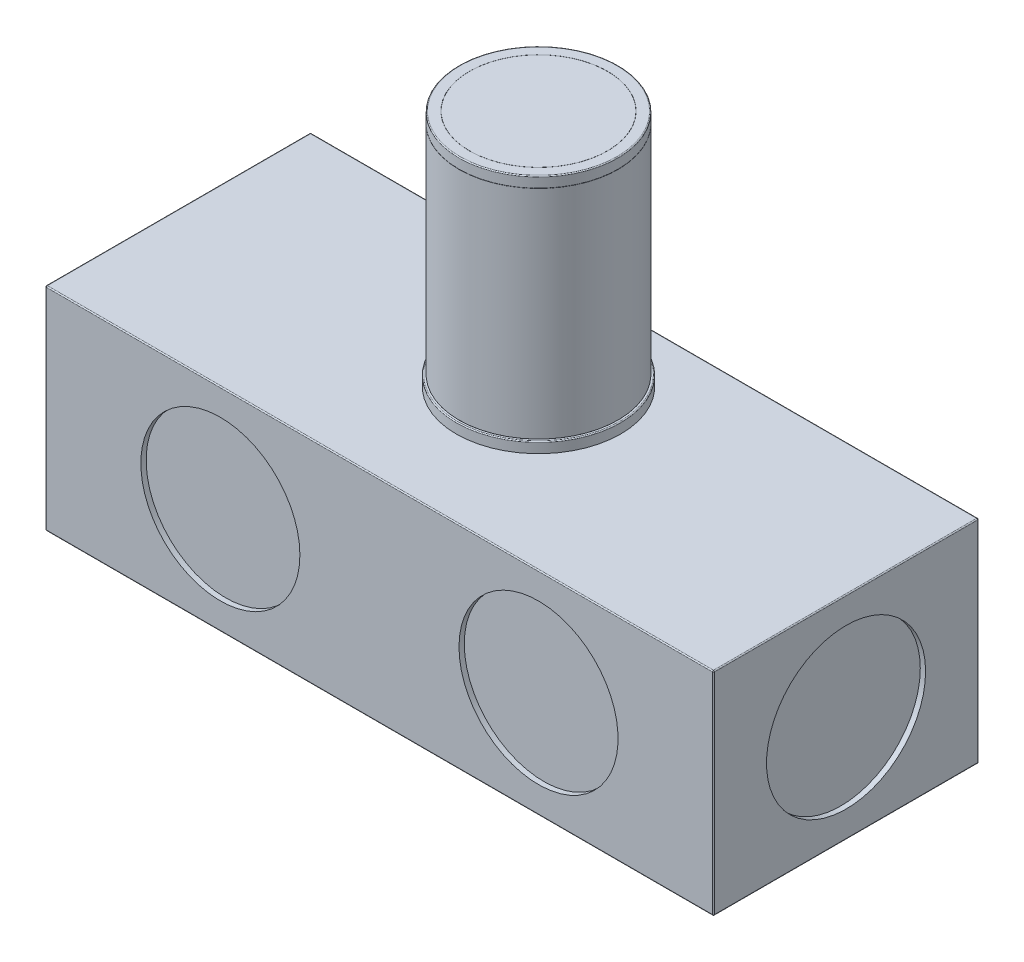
ISO-10303-21;
HEADER;
FILE_DESCRIPTION(('STEP AP214'),'2;1');
FILE_NAME('part.step','',(''),(''),'','','');
FILE_SCHEMA(('AUTOMOTIVE_DESIGN { 1 0 10303 214 1 1 1 1 }'));
ENDSEC;
DATA;
#1=APPLICATION_CONTEXT('core data for automotive mechanical design processes');
#2=APPLICATION_PROTOCOL_DEFINITION('international standard','automotive_design',2000,#1);
#3=PRODUCT_CONTEXT('',#1,'mechanical');
#4=PRODUCT('Part','Part','',(#3));
#5=PRODUCT_RELATED_PRODUCT_CATEGORY('part','',(#4));
#6=PRODUCT_DEFINITION_FORMATION('','',#4);
#7=PRODUCT_DEFINITION_CONTEXT('part definition',#1,'design');
#8=PRODUCT_DEFINITION('design','',#6,#7);
#9=PRODUCT_DEFINITION_SHAPE('','',#8);
#10=(LENGTH_UNIT() NAMED_UNIT(*) SI_UNIT(.MILLI.,.METRE.));
#11=(NAMED_UNIT(*) PLANE_ANGLE_UNIT() SI_UNIT($,.RADIAN.));
#12=(NAMED_UNIT(*) SI_UNIT($,.STERADIAN.) SOLID_ANGLE_UNIT());
#13=UNCERTAINTY_MEASURE_WITH_UNIT(LENGTH_MEASURE(1.E-05),#10,'distance_accuracy_value','');
#14=(GEOMETRIC_REPRESENTATION_CONTEXT(3) GLOBAL_UNCERTAINTY_ASSIGNED_CONTEXT((#13)) GLOBAL_UNIT_ASSIGNED_CONTEXT((#10,
#11,#12)) REPRESENTATION_CONTEXT('',''));
#15=CARTESIAN_POINT('',(0.,0.,0.));
#16=DIRECTION('',(0.,0.,1.));
#17=DIRECTION('',(1.,0.,0.));
#18=AXIS2_PLACEMENT_3D('',#15,#16,#17);
#19=CARTESIAN_POINT('',(-31.5000000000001,0.,25.));
#20=DIRECTION('',(1.,0.,0.));
#21=DIRECTION('',(0.,0.,-1.));
#22=AXIS2_PLACEMENT_3D('',#19,#20,#21);
#23=PLANE('',#22);
#24=DIRECTION('',(0.,-1.,0.));
#25=VECTOR('',#24,1.);
#26=CARTESIAN_POINT('',(-31.5000000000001,0.,0.099999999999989));
#27=LINE('',#26,#25);
#28=CARTESIAN_POINT('',(-31.5000000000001,19.9,0.099999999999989));
#29=VERTEX_POINT('',#28);
#30=CARTESIAN_POINT('',(-31.5000000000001,0.099999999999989,0.099999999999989));
#31=VERTEX_POINT('',#30);
#32=EDGE_CURVE('E421',#29,#31,#27,.T.);
#33=ORIENTED_EDGE('',*,*,#32,.T.);
#34=DIRECTION('',(0.,0.,-1.));
#35=VECTOR('',#34,1.);
#36=CARTESIAN_POINT('',(-31.5000000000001,0.099999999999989,25.));
#37=LINE('',#36,#35);
#38=CARTESIAN_POINT('',(-31.5000000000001,0.099999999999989,24.9));
#39=VERTEX_POINT('',#38);
#40=EDGE_CURVE('E426',#31,#39,#37,.F.);
#41=ORIENTED_EDGE('',*,*,#40,.T.);
#42=DIRECTION('',(0.,-1.,0.));
#43=VECTOR('',#42,1.);
#44=CARTESIAN_POINT('',(-31.5000000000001,0.,24.9));
#45=LINE('',#44,#43);
#46=CARTESIAN_POINT('',(-31.5000000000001,19.9,24.9));
#47=VERTEX_POINT('',#46);
#48=EDGE_CURVE('E423',#39,#47,#45,.F.);
#49=ORIENTED_EDGE('',*,*,#48,.T.);
#50=DIRECTION('',(0.,0.,-1.));
#51=VECTOR('',#50,1.);
#52=CARTESIAN_POINT('',(-31.5000000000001,19.9,25.));
#53=LINE('',#52,#51);
#54=EDGE_CURVE('E419',#47,#29,#53,.T.);
#55=ORIENTED_EDGE('',*,*,#54,.T.);
#56=EDGE_LOOP('',(#33,#41,#49,#55));
#57=FACE_BOUND('',#56,.T.);
#58=CARTESIAN_POINT('',(-31.5000000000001,10.,12.5));
#59=DIRECTION('',(-1.,0.,0.));
#60=DIRECTION('',(0.,0.,1.));
#61=AXIS2_PLACEMENT_3D('',#58,#59,#60);
#62=CIRCLE('',#61,7.5);
#63=CARTESIAN_POINT('',(-31.5000000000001,10.,20.));
#64=VERTEX_POINT('',#63);
#65=EDGE_CURVE('E366',#64,#64,#62,.T.);
#66=ORIENTED_EDGE('',*,*,#65,.F.);
#67=EDGE_LOOP('',(#66));
#68=FACE_BOUND('',#67,.T.);
#69=ADVANCED_FACE('F46',(#57,#68),#23,.F.);
#70=CARTESIAN_POINT('',(-31.5000000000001,0.,25.));
#71=DIRECTION('',(0.,1.,0.));
#72=DIRECTION('',(0.,0.,1.));
#73=AXIS2_PLACEMENT_3D('',#70,#71,#72);
#74=PLANE('',#73);
#75=DIRECTION('',(1.,0.,0.));
#76=VECTOR('',#75,1.);
#77=CARTESIAN_POINT('',(-31.5000000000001,0.,24.9));
#78=LINE('',#77,#76);
#79=CARTESIAN_POINT('',(31.4000000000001,0.,24.9));
#80=VERTEX_POINT('',#79);
#81=CARTESIAN_POINT('',(-31.4000000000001,0.,24.9));
#82=VERTEX_POINT('',#81);
#83=EDGE_CURVE('E414',#80,#82,#78,.F.);
#84=ORIENTED_EDGE('',*,*,#83,.T.);
#85=DIRECTION('',(0.,0.,-1.));
#86=VECTOR('',#85,1.);
#87=CARTESIAN_POINT('',(-31.4000000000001,0.,25.));
#88=LINE('',#87,#86);
#89=CARTESIAN_POINT('',(-31.4000000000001,0.,0.099999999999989));
#90=VERTEX_POINT('',#89);
#91=EDGE_CURVE('E417',#82,#90,#88,.T.);
#92=ORIENTED_EDGE('',*,*,#91,.T.);
#93=DIRECTION('',(1.,0.,0.));
#94=VECTOR('',#93,1.);
#95=CARTESIAN_POINT('',(31.5000000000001,0.,0.099999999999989));
#96=LINE('',#95,#94);
#97=CARTESIAN_POINT('',(31.4000000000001,0.,0.099999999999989));
#98=VERTEX_POINT('',#97);
#99=EDGE_CURVE('E412',#90,#98,#96,.T.);
#100=ORIENTED_EDGE('',*,*,#99,.T.);
#101=DIRECTION('',(0.,0.,-1.));
#102=VECTOR('',#101,1.);
#103=CARTESIAN_POINT('',(31.4000000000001,0.,25.));
#104=LINE('',#103,#102);
#105=EDGE_CURVE('E410',#98,#80,#104,.F.);
#106=ORIENTED_EDGE('',*,*,#105,.T.);
#107=EDGE_LOOP('',(#84,#92,#100,#106));
#108=FACE_BOUND('',#107,.T.);
#109=CARTESIAN_POINT('',(0.,0.,10.));
#110=DIRECTION('',(0.,1.,0.));
#111=DIRECTION('',(0.,0.,1.));
#112=AXIS2_PLACEMENT_3D('',#109,#110,#111);
#113=CIRCLE('',#112,7.74999999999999);
#114=CARTESIAN_POINT('',(0.,0.,17.75));
#115=VERTEX_POINT('',#114);
#116=EDGE_CURVE('E363',#115,#115,#113,.T.);
#117=ORIENTED_EDGE('',*,*,#116,.T.);
#118=EDGE_LOOP('',(#117));
#119=FACE_BOUND('',#118,.T.);
#120=ADVANCED_FACE('F525',(#108,#119),#74,.F.);
#121=CARTESIAN_POINT('',(31.5000000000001,0.,25.));
#122=DIRECTION('',(-1.,0.,0.));
#123=DIRECTION('',(0.,0.,1.));
#124=AXIS2_PLACEMENT_3D('',#121,#122,#123);
#125=PLANE('',#124);
#126=DIRECTION('',(0.,1.,0.));
#127=VECTOR('',#126,1.);
#128=CARTESIAN_POINT('',(31.5000000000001,0.,24.9));
#129=LINE('',#128,#127);
#130=CARTESIAN_POINT('',(31.5000000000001,19.9,24.9));
#131=VERTEX_POINT('',#130);
#132=CARTESIAN_POINT('',(31.5000000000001,0.099999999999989,24.9));
#133=VERTEX_POINT('',#132);
#134=EDGE_CURVE('E405',#131,#133,#129,.F.);
#135=ORIENTED_EDGE('',*,*,#134,.T.);
#136=DIRECTION('',(0.,0.,-1.));
#137=VECTOR('',#136,1.);
#138=CARTESIAN_POINT('',(31.5000000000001,0.099999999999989,25.));
#139=LINE('',#138,#137);
#140=CARTESIAN_POINT('',(31.5000000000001,0.099999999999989,0.099999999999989));
#141=VERTEX_POINT('',#140);
#142=EDGE_CURVE('E408',#133,#141,#139,.T.);
#143=ORIENTED_EDGE('',*,*,#142,.T.);
#144=DIRECTION('',(0.,1.,0.));
#145=VECTOR('',#144,1.);
#146=CARTESIAN_POINT('',(31.5000000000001,20.,0.099999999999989));
#147=LINE('',#146,#145);
#148=CARTESIAN_POINT('',(31.5000000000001,19.9,0.099999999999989));
#149=VERTEX_POINT('',#148);
#150=EDGE_CURVE('E403',#141,#149,#147,.T.);
#151=ORIENTED_EDGE('',*,*,#150,.T.);
#152=DIRECTION('',(0.,0.,-1.));
#153=VECTOR('',#152,1.);
#154=CARTESIAN_POINT('',(31.5000000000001,19.9,25.));
#155=LINE('',#154,#153);
#156=EDGE_CURVE('E401',#149,#131,#155,.F.);
#157=ORIENTED_EDGE('',*,*,#156,.T.);
#158=EDGE_LOOP('',(#135,#143,#151,#157));
#159=FACE_BOUND('',#158,.T.);
#160=CARTESIAN_POINT('',(31.5000000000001,10.,12.5));
#161=DIRECTION('',(1.,0.,0.));
#162=DIRECTION('',(0.,0.,-1.));
#163=AXIS2_PLACEMENT_3D('',#160,#161,#162);
#164=CIRCLE('',#163,7.5);
#165=CARTESIAN_POINT('',(31.5000000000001,10.,4.99999999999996));
#166=VERTEX_POINT('',#165);
#167=EDGE_CURVE('E370',#166,#166,#164,.T.);
#168=ORIENTED_EDGE('',*,*,#167,.F.);
#169=EDGE_LOOP('',(#168));
#170=FACE_BOUND('',#169,.T.);
#171=ADVANCED_FACE('F515',(#159,#170),#125,.F.);
#172=CARTESIAN_POINT('',(-31.5000000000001,20.,25.));
#173=DIRECTION('',(0.,-1.,0.));
#174=DIRECTION('',(0.,0.,-1.));
#175=AXIS2_PLACEMENT_3D('',#172,#173,#174);
#176=PLANE('',#175);
#177=DIRECTION('',(-1.,0.,0.));
#178=VECTOR('',#177,1.);
#179=CARTESIAN_POINT('',(-31.5000000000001,20.,0.099999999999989));
#180=LINE('',#179,#178);
#181=CARTESIAN_POINT('',(31.4000000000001,20.,0.099999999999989));
#182=VERTEX_POINT('',#181);
#183=CARTESIAN_POINT('',(-31.4000000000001,20.,0.099999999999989));
#184=VERTEX_POINT('',#183);
#185=EDGE_CURVE('E394',#182,#184,#180,.T.);
#186=ORIENTED_EDGE('',*,*,#185,.T.);
#187=DIRECTION('',(0.,0.,-1.));
#188=VECTOR('',#187,1.);
#189=CARTESIAN_POINT('',(-31.4000000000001,20.,25.));
#190=LINE('',#189,#188);
#191=CARTESIAN_POINT('',(-31.4000000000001,20.,24.9));
#192=VERTEX_POINT('',#191);
#193=EDGE_CURVE('E399',#184,#192,#190,.F.);
#194=ORIENTED_EDGE('',*,*,#193,.T.);
#195=DIRECTION('',(-1.,0.,0.));
#196=VECTOR('',#195,1.);
#197=CARTESIAN_POINT('',(-31.5000000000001,20.,24.9));
#198=LINE('',#197,#196);
#199=CARTESIAN_POINT('',(31.4000000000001,20.,24.9));
#200=VERTEX_POINT('',#199);
#201=EDGE_CURVE('E396',#192,#200,#198,.F.);
#202=ORIENTED_EDGE('',*,*,#201,.T.);
#203=DIRECTION('',(0.,0.,-1.));
#204=VECTOR('',#203,1.);
#205=CARTESIAN_POINT('',(31.4000000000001,20.,25.));
#206=LINE('',#205,#204);
#207=EDGE_CURVE('E392',#200,#182,#206,.T.);
#208=ORIENTED_EDGE('',*,*,#207,.T.);
#209=EDGE_LOOP('',(#186,#194,#202,#208));
#210=FACE_BOUND('',#209,.T.);
#211=CARTESIAN_POINT('',(0.,20.,10.));
#212=DIRECTION('',(0.,-1.,0.));
#213=DIRECTION('',(0.,0.,-1.));
#214=AXIS2_PLACEMENT_3D('',#211,#212,#213);
#215=CIRCLE('',#214,7.74999999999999);
#216=CARTESIAN_POINT('',(0.,20.,2.25000000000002));
#217=VERTEX_POINT('',#216);
#218=EDGE_CURVE('E362',#217,#217,#215,.T.);
#219=ORIENTED_EDGE('',*,*,#218,.T.);
#220=EDGE_LOOP('',(#219));
#221=FACE_BOUND('',#220,.T.);
#222=ADVANCED_FACE('F559',(#210,#221),#176,.F.);
#223=CARTESIAN_POINT('',(-31.5000000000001,20.,25.));
#224=DIRECTION('',(0.,0.,-1.));
#225=DIRECTION('',(-1.,0.,0.));
#226=AXIS2_PLACEMENT_3D('',#223,#224,#225);
#227=PLANE('',#226);
#228=CARTESIAN_POINT('',(14.9999999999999,10.,25.));
#229=DIRECTION('',(0.,0.,1.));
#230=DIRECTION('',(-1.,0.,0.));
#231=AXIS2_PLACEMENT_3D('',#228,#229,#230);
#232=CIRCLE('',#231,7.5);
#233=CARTESIAN_POINT('',(7.4999999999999,10.,25.));
#234=VERTEX_POINT('',#233);
#235=EDGE_CURVE('E1160',#234,#234,#232,.T.);
#236=ORIENTED_EDGE('',*,*,#235,.F.);
#237=EDGE_LOOP('',(#236));
#238=FACE_BOUND('',#237,.T.);
#239=CARTESIAN_POINT('',(-14.9999999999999,10.,25.));
#240=DIRECTION('',(0.,0.,1.));
#241=DIRECTION('',(1.,0.,0.));
#242=AXIS2_PLACEMENT_3D('',#239,#240,#241);
#243=CIRCLE('',#242,7.5);
#244=CARTESIAN_POINT('',(-7.4999999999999,10.,25.));
#245=VERTEX_POINT('',#244);
#246=EDGE_CURVE('E1164',#245,#245,#243,.T.);
#247=ORIENTED_EDGE('',*,*,#246,.F.);
#248=EDGE_LOOP('',(#247));
#249=FACE_BOUND('',#248,.T.);
#250=DIRECTION('',(0.,1.,0.));
#251=VECTOR('',#250,1.);
#252=CARTESIAN_POINT('',(31.4000000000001,20.,25.));
#253=LINE('',#252,#251);
#254=CARTESIAN_POINT('',(31.4000000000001,0.099999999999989,25.));
#255=VERTEX_POINT('',#254);
#256=CARTESIAN_POINT('',(31.4000000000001,19.9,25.));
#257=VERTEX_POINT('',#256);
#258=EDGE_CURVE('E387',#255,#257,#253,.T.);
#259=ORIENTED_EDGE('',*,*,#258,.T.);
#260=DIRECTION('',(-1.,0.,0.));
#261=VECTOR('',#260,1.);
#262=CARTESIAN_POINT('',(-31.5000000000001,19.9,25.));
#263=LINE('',#262,#261);
#264=CARTESIAN_POINT('',(-31.4000000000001,19.9,25.));
#265=VERTEX_POINT('',#264);
#266=EDGE_CURVE('E389',#257,#265,#263,.T.);
#267=ORIENTED_EDGE('',*,*,#266,.T.);
#268=DIRECTION('',(0.,-1.,0.));
#269=VECTOR('',#268,1.);
#270=CARTESIAN_POINT('',(-31.4000000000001,20.,25.));
#271=LINE('',#270,#269);
#272=CARTESIAN_POINT('',(-31.4000000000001,0.099999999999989,25.));
#273=VERTEX_POINT('',#272);
#274=EDGE_CURVE('E383',#265,#273,#271,.T.);
#275=ORIENTED_EDGE('',*,*,#274,.T.);
#276=DIRECTION('',(1.,0.,0.));
#277=VECTOR('',#276,1.);
#278=CARTESIAN_POINT('',(-31.5000000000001,0.099999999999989,25.));
#279=LINE('',#278,#277);
#280=EDGE_CURVE('E385',#273,#255,#279,.T.);
#281=ORIENTED_EDGE('',*,*,#280,.T.);
#282=EDGE_LOOP('',(#259,#267,#275,#281));
#283=FACE_BOUND('',#282,.T.);
#284=ADVANCED_FACE('F1130',(#238,#249,#283),#227,.F.);
#285=CARTESIAN_POINT('',(-31.5000000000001,20.,0.));
#286=DIRECTION('',(0.,0.,-1.));
#287=DIRECTION('',(-1.,0.,0.));
#288=AXIS2_PLACEMENT_3D('',#285,#286,#287);
#289=PLANE('',#288);
#290=DIRECTION('',(0.,1.,0.));
#291=VECTOR('',#290,1.);
#292=CARTESIAN_POINT('',(31.4000000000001,0.,0.));
#293=LINE('',#292,#291);
#294=CARTESIAN_POINT('',(31.4000000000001,19.9,0.));
#295=VERTEX_POINT('',#294);
#296=CARTESIAN_POINT('',(31.4000000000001,0.099999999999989,0.));
#297=VERTEX_POINT('',#296);
#298=EDGE_CURVE('E55',#295,#297,#293,.F.);
#299=ORIENTED_EDGE('',*,*,#298,.T.);
#300=DIRECTION('',(1.,0.,0.));
#301=VECTOR('',#300,1.);
#302=CARTESIAN_POINT('',(-31.5000000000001,0.099999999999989,0.));
#303=LINE('',#302,#301);
#304=CARTESIAN_POINT('',(-31.4000000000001,0.099999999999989,0.));
#305=VERTEX_POINT('',#304);
#306=EDGE_CURVE('E13',#297,#305,#303,.F.);
#307=ORIENTED_EDGE('',*,*,#306,.T.);
#308=DIRECTION('',(0.,-1.,0.));
#309=VECTOR('',#308,1.);
#310=CARTESIAN_POINT('',(-31.4000000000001,20.,0.));
#311=LINE('',#310,#309);
#312=CARTESIAN_POINT('',(-31.4000000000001,19.9,0.));
#313=VERTEX_POINT('',#312);
#314=EDGE_CURVE('E428',#305,#313,#311,.F.);
#315=ORIENTED_EDGE('',*,*,#314,.T.);
#316=DIRECTION('',(-1.,0.,0.));
#317=VECTOR('',#316,1.);
#318=CARTESIAN_POINT('',(31.5000000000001,19.9,0.));
#319=LINE('',#318,#317);
#320=EDGE_CURVE('E66',#313,#295,#319,.F.);
#321=ORIENTED_EDGE('',*,*,#320,.T.);
#322=EDGE_LOOP('',(#299,#307,#315,#321));
#323=FACE_BOUND('',#322,.T.);
#324=ADVANCED_FACE('F540',(#323),#289,.T.);
#325=CARTESIAN_POINT('',(30.9999999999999,10.,12.5));
#326=DIRECTION('',(1.,0.,0.));
#327=DIRECTION('',(0.,0.,-1.));
#328=AXIS2_PLACEMENT_3D('',#325,#326,#327);
#329=CYLINDRICAL_SURFACE('',#328,7.5);
#330=CARTESIAN_POINT('',(30.9999999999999,10.,12.5));
#331=DIRECTION('',(1.,0.,0.));
#332=DIRECTION('',(0.,0.,-1.));
#333=AXIS2_PLACEMENT_3D('',#330,#331,#332);
#334=CIRCLE('',#333,7.5);
#335=CARTESIAN_POINT('',(30.9999999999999,10.,4.99999999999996));
#336=VERTEX_POINT('',#335);
#337=EDGE_CURVE('E373',#336,#336,#334,.T.);
#338=ORIENTED_EDGE('',*,*,#337,.F.);
#339=EDGE_LOOP('',(#338));
#340=FACE_BOUND('',#339,.T.);
#341=ORIENTED_EDGE('',*,*,#167,.T.);
#342=EDGE_LOOP('',(#341));
#343=FACE_BOUND('',#342,.T.);
#344=ADVANCED_FACE('F1115',(#340,#343),#329,.F.);
#345=CARTESIAN_POINT('',(30.9999999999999,10.,12.5));
#346=DIRECTION('',(1.,0.,0.));
#347=DIRECTION('',(0.,0.,-1.));
#348=AXIS2_PLACEMENT_3D('',#345,#346,#347);
#349=PLANE('',#348);
#350=ORIENTED_EDGE('',*,*,#337,.T.);
#351=EDGE_LOOP('',(#350));
#352=FACE_BOUND('',#351,.T.);
#353=ADVANCED_FACE('F1107',(#352),#349,.T.);
#354=CARTESIAN_POINT('',(-30.9999999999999,10.,12.5));
#355=DIRECTION('',(-1.,0.,0.));
#356=DIRECTION('',(0.,0.,1.));
#357=AXIS2_PLACEMENT_3D('',#354,#355,#356);
#358=CYLINDRICAL_SURFACE('',#357,7.5);
#359=CARTESIAN_POINT('',(-30.9999999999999,10.,12.5));
#360=DIRECTION('',(-1.,0.,0.));
#361=DIRECTION('',(0.,0.,1.));
#362=AXIS2_PLACEMENT_3D('',#359,#360,#361);
#363=CIRCLE('',#362,7.5);
#364=CARTESIAN_POINT('',(-30.9999999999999,10.,20.));
#365=VERTEX_POINT('',#364);
#366=EDGE_CURVE('E367',#365,#365,#363,.T.);
#367=ORIENTED_EDGE('',*,*,#366,.F.);
#368=EDGE_LOOP('',(#367));
#369=FACE_BOUND('',#368,.T.);
#370=ORIENTED_EDGE('',*,*,#65,.T.);
#371=EDGE_LOOP('',(#370));
#372=FACE_BOUND('',#371,.T.);
#373=ADVANCED_FACE('F1099',(#369,#372),#358,.F.);
#374=CARTESIAN_POINT('',(-30.9999999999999,10.,12.5));
#375=DIRECTION('',(-1.,0.,0.));
#376=DIRECTION('',(0.,0.,1.));
#377=AXIS2_PLACEMENT_3D('',#374,#375,#376);
#378=PLANE('',#377);
#379=ORIENTED_EDGE('',*,*,#366,.T.);
#380=EDGE_LOOP('',(#379));
#381=FACE_BOUND('',#380,.T.);
#382=ADVANCED_FACE('F1092',(#381),#378,.T.);
#383=CARTESIAN_POINT('',(0.,20.91,10.));
#384=DIRECTION('',(0.,1.,0.));
#385=DIRECTION('',(0.,0.,1.));
#386=AXIS2_PLACEMENT_3D('',#383,#384,#385);
#387=TOROIDAL_SURFACE('',#386,7.65999999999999,0.0899999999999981);
#388=CARTESIAN_POINT('',(0.,20.91,10.));
#389=DIRECTION('',(0.,1.,0.));
#390=DIRECTION('',(0.,0.,1.));
#391=AXIS2_PLACEMENT_3D('',#388,#389,#390);
#392=CIRCLE('',#391,7.74999999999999);
#393=CARTESIAN_POINT('',(0.,20.91,17.75));
#394=VERTEX_POINT('',#393);
#395=EDGE_CURVE('E308',#394,#394,#392,.T.);
#396=ORIENTED_EDGE('',*,*,#395,.T.);
#397=EDGE_LOOP('',(#396));
#398=FACE_BOUND('',#397,.T.);
#399=CARTESIAN_POINT('',(0.,20.9999999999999,10.));
#400=DIRECTION('',(0.,1.,0.));
#401=DIRECTION('',(0.,0.,1.));
#402=AXIS2_PLACEMENT_3D('',#399,#400,#401);
#403=CIRCLE('',#402,7.65999999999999);
#404=CARTESIAN_POINT('',(0.,20.9999999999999,17.66));
#405=VERTEX_POINT('',#404);
#406=EDGE_CURVE('E311',#405,#405,#403,.T.);
#407=ORIENTED_EDGE('',*,*,#406,.F.);
#408=EDGE_LOOP('',(#407));
#409=FACE_BOUND('',#408,.T.);
#410=ADVANCED_FACE('F1084',(#398,#409),#387,.T.);
#411=CARTESIAN_POINT('',(0.,20.9999999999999,17.66));
#412=DIRECTION('',(0.,1.,0.));
#413=DIRECTION('',(0.,0.,1.));
#414=AXIS2_PLACEMENT_3D('',#411,#412,#413);
#415=PLANE('',#414);
#416=ORIENTED_EDGE('',*,*,#406,.T.);
#417=EDGE_LOOP('',(#416));
#418=FACE_BOUND('',#417,.T.);
#419=CARTESIAN_POINT('',(0.,20.9999999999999,10.));
#420=DIRECTION('',(0.,1.,0.));
#421=DIRECTION('',(0.,0.,1.));
#422=AXIS2_PLACEMENT_3D('',#419,#420,#421);
#423=CIRCLE('',#422,7.4);
#424=CARTESIAN_POINT('',(0.,20.9999999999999,17.4));
#425=VERTEX_POINT('',#424);
#426=EDGE_CURVE('E314',#425,#425,#423,.T.);
#427=ORIENTED_EDGE('',*,*,#426,.F.);
#428=EDGE_LOOP('',(#427));
#429=FACE_BOUND('',#428,.T.);
#430=ADVANCED_FACE('F1076',(#418,#429),#415,.T.);
#431=CARTESIAN_POINT('',(0.,42.5,10.));
#432=DIRECTION('',(0.,1.,0.));
#433=DIRECTION('',(0.,0.,1.));
#434=AXIS2_PLACEMENT_3D('',#431,#432,#433);
#435=CYLINDRICAL_SURFACE('',#434,7.4);
#436=ORIENTED_EDGE('',*,*,#426,.T.);
#437=EDGE_LOOP('',(#436));
#438=FACE_BOUND('',#437,.T.);
#439=CARTESIAN_POINT('',(0.,21.01,10.));
#440=DIRECTION('',(0.,1.,0.));
#441=DIRECTION('',(0.,0.,1.));
#442=AXIS2_PLACEMENT_3D('',#439,#440,#441);
#443=CIRCLE('',#442,7.4);
#444=CARTESIAN_POINT('',(0.,21.01,17.4));
#445=VERTEX_POINT('',#444);
#446=EDGE_CURVE('E317',#445,#445,#443,.T.);
#447=ORIENTED_EDGE('',*,*,#446,.F.);
#448=EDGE_LOOP('',(#447));
#449=FACE_BOUND('',#448,.T.);
#450=ADVANCED_FACE('F1068',(#438,#449),#435,.T.);
#451=CARTESIAN_POINT('',(0.,21.01,17.4));
#452=DIRECTION('',(0.,-1.,0.));
#453=DIRECTION('',(0.,0.,-1.));
#454=AXIS2_PLACEMENT_3D('',#451,#452,#453);
#455=PLANE('',#454);
#456=ORIENTED_EDGE('',*,*,#446,.T.);
#457=EDGE_LOOP('',(#456));
#458=FACE_BOUND('',#457,.T.);
#459=CARTESIAN_POINT('',(0.,21.01,10.));
#460=DIRECTION('',(0.,1.,0.));
#461=DIRECTION('',(0.,0.,1.));
#462=AXIS2_PLACEMENT_3D('',#459,#460,#461);
#463=CIRCLE('',#462,7.491);
#464=CARTESIAN_POINT('',(0.,21.01,17.491));
#465=VERTEX_POINT('',#464);
#466=EDGE_CURVE('E320',#465,#465,#463,.T.);
#467=ORIENTED_EDGE('',*,*,#466,.F.);
#468=EDGE_LOOP('',(#467));
#469=FACE_BOUND('',#468,.T.);
#470=ADVANCED_FACE('F1060',(#458,#469),#455,.T.);
#471=CARTESIAN_POINT('',(0.,21.0189999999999,10.));
#472=DIRECTION('',(0.,1.,0.));
#473=DIRECTION('',(0.,0.,1.));
#474=AXIS2_PLACEMENT_3D('',#471,#472,#473);
#475=TOROIDAL_SURFACE('',#474,7.491,0.00899999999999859);
#476=ORIENTED_EDGE('',*,*,#466,.T.);
#477=EDGE_LOOP('',(#476));
#478=FACE_BOUND('',#477,.T.);
#479=CARTESIAN_POINT('',(0.,21.0189999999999,10.));
#480=DIRECTION('',(0.,1.,0.));
#481=DIRECTION('',(0.,0.,1.));
#482=AXIS2_PLACEMENT_3D('',#479,#480,#481);
#483=CIRCLE('',#482,7.49999999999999);
#484=CARTESIAN_POINT('',(0.,21.0189999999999,17.5));
#485=VERTEX_POINT('',#484);
#486=EDGE_CURVE('E323',#485,#485,#483,.T.);
#487=ORIENTED_EDGE('',*,*,#486,.F.);
#488=EDGE_LOOP('',(#487));
#489=FACE_BOUND('',#488,.T.);
#490=ADVANCED_FACE('F1052',(#478,#489),#475,.T.);
#491=CARTESIAN_POINT('',(0.,42.5,10.));
#492=DIRECTION('',(0.,1.,0.));
#493=DIRECTION('',(0.,0.,1.));
#494=AXIS2_PLACEMENT_3D('',#491,#492,#493);
#495=CYLINDRICAL_SURFACE('',#494,7.5);
#496=ORIENTED_EDGE('',*,*,#486,.T.);
#497=EDGE_LOOP('',(#496));
#498=FACE_BOUND('',#497,.T.);
#499=CARTESIAN_POINT('',(0.,41.4810000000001,10.));
#500=DIRECTION('',(0.,1.,0.));
#501=DIRECTION('',(0.,0.,1.));
#502=AXIS2_PLACEMENT_3D('',#499,#500,#501);
#503=CIRCLE('',#502,7.5);
#504=CARTESIAN_POINT('',(0.,41.4810000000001,17.5));
#505=VERTEX_POINT('',#504);
#506=EDGE_CURVE('E326',#505,#505,#503,.T.);
#507=ORIENTED_EDGE('',*,*,#506,.F.);
#508=EDGE_LOOP('',(#507));
#509=FACE_BOUND('',#508,.T.);
#510=ADVANCED_FACE('F1044',(#498,#509),#495,.T.);
#511=CARTESIAN_POINT('',(0.,41.4809999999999,10.));
#512=DIRECTION('',(0.,1.,0.));
#513=DIRECTION('',(0.,0.,1.));
#514=AXIS2_PLACEMENT_3D('',#511,#512,#513);
#515=TOROIDAL_SURFACE('',#514,7.491,0.0090000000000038);
#516=ORIENTED_EDGE('',*,*,#506,.T.);
#517=EDGE_LOOP('',(#516));
#518=FACE_BOUND('',#517,.T.);
#519=CARTESIAN_POINT('',(0.,41.49,10.));
#520=DIRECTION('',(0.,1.,0.));
#521=DIRECTION('',(0.,0.,1.));
#522=AXIS2_PLACEMENT_3D('',#519,#520,#521);
#523=CIRCLE('',#522,7.491);
#524=CARTESIAN_POINT('',(0.,41.49,17.491));
#525=VERTEX_POINT('',#524);
#526=EDGE_CURVE('E329',#525,#525,#523,.T.);
#527=ORIENTED_EDGE('',*,*,#526,.F.);
#528=EDGE_LOOP('',(#527));
#529=FACE_BOUND('',#528,.T.);
#530=ADVANCED_FACE('F1036',(#518,#529),#515,.T.);
#531=CARTESIAN_POINT('',(0.,41.49,17.491));
#532=DIRECTION('',(0.,1.,0.));
#533=DIRECTION('',(0.,0.,1.));
#534=AXIS2_PLACEMENT_3D('',#531,#532,#533);
#535=PLANE('',#534);
#536=ORIENTED_EDGE('',*,*,#526,.T.);
#537=EDGE_LOOP('',(#536));
#538=FACE_BOUND('',#537,.T.);
#539=CARTESIAN_POINT('',(0.,41.49,10.));
#540=DIRECTION('',(0.,1.,0.));
#541=DIRECTION('',(0.,0.,1.));
#542=AXIS2_PLACEMENT_3D('',#539,#540,#541);
#543=CIRCLE('',#542,7.49);
#544=CARTESIAN_POINT('',(0.,41.49,17.49));
#545=VERTEX_POINT('',#544);
#546=EDGE_CURVE('E332',#545,#545,#543,.T.);
#547=ORIENTED_EDGE('',*,*,#546,.F.);
#548=EDGE_LOOP('',(#547));
#549=FACE_BOUND('',#548,.T.);
#550=ADVANCED_FACE('F1028',(#538,#549),#535,.T.);
#551=CARTESIAN_POINT('',(0.,42.5,10.));
#552=DIRECTION('',(0.,1.,0.));
#553=DIRECTION('',(0.,0.,1.));
#554=AXIS2_PLACEMENT_3D('',#551,#552,#553);
#555=CYLINDRICAL_SURFACE('',#554,7.49);
#556=ORIENTED_EDGE('',*,*,#546,.T.);
#557=EDGE_LOOP('',(#556));
#558=FACE_BOUND('',#557,.T.);
#559=CARTESIAN_POINT('',(0.,41.5000000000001,10.));
#560=DIRECTION('',(0.,1.,0.));
#561=DIRECTION('',(0.,0.,1.));
#562=AXIS2_PLACEMENT_3D('',#559,#560,#561);
#563=CIRCLE('',#562,7.49);
#564=CARTESIAN_POINT('',(0.,41.5000000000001,17.49));
#565=VERTEX_POINT('',#564);
#566=EDGE_CURVE('E335',#565,#565,#563,.T.);
#567=ORIENTED_EDGE('',*,*,#566,.F.);
#568=EDGE_LOOP('',(#567));
#569=FACE_BOUND('',#568,.T.);
#570=ADVANCED_FACE('F1020',(#558,#569),#555,.T.);
#571=CARTESIAN_POINT('',(0.,41.5000000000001,17.49));
#572=DIRECTION('',(0.,-1.,0.));
#573=DIRECTION('',(0.,0.,-1.));
#574=AXIS2_PLACEMENT_3D('',#571,#572,#573);
#575=PLANE('',#574);
#576=ORIENTED_EDGE('',*,*,#566,.T.);
#577=EDGE_LOOP('',(#576));
#578=FACE_BOUND('',#577,.T.);
#579=CARTESIAN_POINT('',(0.,41.5000000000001,10.));
#580=DIRECTION('',(0.,1.,0.));
#581=DIRECTION('',(0.,0.,1.));
#582=AXIS2_PLACEMENT_3D('',#579,#580,#581);
#583=CIRCLE('',#582,7.491);
#584=CARTESIAN_POINT('',(0.,41.5000000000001,17.491));
#585=VERTEX_POINT('',#584);
#586=EDGE_CURVE('E338',#585,#585,#583,.T.);
#587=ORIENTED_EDGE('',*,*,#586,.F.);
#588=EDGE_LOOP('',(#587));
#589=FACE_BOUND('',#588,.T.);
#590=ADVANCED_FACE('F1012',(#578,#589),#575,.T.);
#591=CARTESIAN_POINT('',(0.,41.509,10.));
#592=DIRECTION('',(0.,1.,0.));
#593=DIRECTION('',(0.,0.,1.));
#594=AXIS2_PLACEMENT_3D('',#591,#592,#593);
#595=TOROIDAL_SURFACE('',#594,7.491,0.00900000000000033);
#596=ORIENTED_EDGE('',*,*,#586,.T.);
#597=EDGE_LOOP('',(#596));
#598=FACE_BOUND('',#597,.T.);
#599=CARTESIAN_POINT('',(0.,41.509,10.));
#600=DIRECTION('',(0.,1.,0.));
#601=DIRECTION('',(0.,0.,1.));
#602=AXIS2_PLACEMENT_3D('',#599,#600,#601);
#603=CIRCLE('',#602,7.5);
#604=CARTESIAN_POINT('',(0.,41.509,17.5));
#605=VERTEX_POINT('',#604);
#606=EDGE_CURVE('E341',#605,#605,#603,.T.);
#607=ORIENTED_EDGE('',*,*,#606,.F.);
#608=EDGE_LOOP('',(#607));
#609=FACE_BOUND('',#608,.T.);
#610=ADVANCED_FACE('F1004',(#598,#609),#595,.T.);
#611=CARTESIAN_POINT('',(0.,42.5,10.));
#612=DIRECTION('',(0.,1.,0.));
#613=DIRECTION('',(0.,0.,1.));
#614=AXIS2_PLACEMENT_3D('',#611,#612,#613);
#615=CYLINDRICAL_SURFACE('',#614,7.5);
#616=ORIENTED_EDGE('',*,*,#606,.T.);
#617=EDGE_LOOP('',(#616));
#618=FACE_BOUND('',#617,.T.);
#619=CARTESIAN_POINT('',(0.,42.4100000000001,10.));
#620=DIRECTION('',(0.,1.,0.));
#621=DIRECTION('',(0.,0.,1.));
#622=AXIS2_PLACEMENT_3D('',#619,#620,#621);
#623=CIRCLE('',#622,7.5);
#624=CARTESIAN_POINT('',(0.,42.4100000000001,17.5));
#625=VERTEX_POINT('',#624);
#626=EDGE_CURVE('E344',#625,#625,#623,.T.);
#627=ORIENTED_EDGE('',*,*,#626,.F.);
#628=EDGE_LOOP('',(#627));
#629=FACE_BOUND('',#628,.T.);
#630=ADVANCED_FACE('F996',(#618,#629),#615,.T.);
#631=CARTESIAN_POINT('',(0.,42.4100000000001,10.));
#632=DIRECTION('',(0.,1.,0.));
#633=DIRECTION('',(0.,0.,1.));
#634=AXIS2_PLACEMENT_3D('',#631,#632,#633);
#635=TOROIDAL_SURFACE('',#634,7.41,0.0900000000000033);
#636=ORIENTED_EDGE('',*,*,#626,.T.);
#637=EDGE_LOOP('',(#636));
#638=FACE_BOUND('',#637,.T.);
#639=CARTESIAN_POINT('',(0.,42.5,10.));
#640=DIRECTION('',(0.,1.,0.));
#641=DIRECTION('',(0.,0.,1.));
#642=AXIS2_PLACEMENT_3D('',#639,#640,#641);
#643=CIRCLE('',#642,7.41);
#644=CARTESIAN_POINT('',(0.,42.5,17.41));
#645=VERTEX_POINT('',#644);
#646=EDGE_CURVE('E347',#645,#645,#643,.T.);
#647=ORIENTED_EDGE('',*,*,#646,.F.);
#648=EDGE_LOOP('',(#647));
#649=FACE_BOUND('',#648,.T.);
#650=ADVANCED_FACE('F990',(#638,#649),#635,.T.);
#651=CARTESIAN_POINT('',(0.,42.5,17.41));
#652=DIRECTION('',(0.,1.,0.));
#653=DIRECTION('',(0.,0.,1.));
#654=AXIS2_PLACEMENT_3D('',#651,#652,#653);
#655=PLANE('',#654);
#656=ORIENTED_EDGE('',*,*,#646,.T.);
#657=EDGE_LOOP('',(#656));
#658=FACE_BOUND('',#657,.T.);
#659=CARTESIAN_POINT('',(0.,42.5,10.));
#660=DIRECTION('',(0.,1.,0.));
#661=DIRECTION('',(0.,0.,1.));
#662=AXIS2_PLACEMENT_3D('',#659,#660,#661);
#663=CIRCLE('',#662,6.51);
#664=CARTESIAN_POINT('',(0.,42.5,16.51));
#665=VERTEX_POINT('',#664);
#666=EDGE_CURVE('E350',#665,#665,#663,.T.);
#667=ORIENTED_EDGE('',*,*,#666,.F.);
#668=EDGE_LOOP('',(#667));
#669=FACE_BOUND('',#668,.T.);
#670=ADVANCED_FACE('F982',(#658,#669),#655,.T.);
#671=CARTESIAN_POINT('',(0.,42.5,10.));
#672=DIRECTION('',(0.,1.,0.));
#673=DIRECTION('',(0.,0.,1.));
#674=AXIS2_PLACEMENT_3D('',#671,#672,#673);
#675=CYLINDRICAL_SURFACE('',#674,6.51);
#676=ORIENTED_EDGE('',*,*,#666,.T.);
#677=EDGE_LOOP('',(#676));
#678=FACE_BOUND('',#677,.T.);
#679=CARTESIAN_POINT('',(0.,42.4,10.));
#680=DIRECTION('',(0.,1.,0.));
#681=DIRECTION('',(0.,0.,1.));
#682=AXIS2_PLACEMENT_3D('',#679,#680,#681);
#683=CIRCLE('',#682,6.51);
#684=CARTESIAN_POINT('',(0.,42.4,16.51));
#685=VERTEX_POINT('',#684);
#686=EDGE_CURVE('E353',#685,#685,#683,.T.);
#687=ORIENTED_EDGE('',*,*,#686,.F.);
#688=EDGE_LOOP('',(#687));
#689=FACE_BOUND('',#688,.T.);
#690=ADVANCED_FACE('F974',(#678,#689),#675,.F.);
#691=CARTESIAN_POINT('',(0.,42.4,16.51));
#692=DIRECTION('',(0.,1.,0.));
#693=DIRECTION('',(0.,0.,1.));
#694=AXIS2_PLACEMENT_3D('',#691,#692,#693);
#695=PLANE('',#694);
#696=ORIENTED_EDGE('',*,*,#686,.T.);
#697=EDGE_LOOP('',(#696));
#698=FACE_BOUND('',#697,.T.);
#699=CARTESIAN_POINT('',(0.,42.4,10.));
#700=DIRECTION('',(0.,1.,0.));
#701=DIRECTION('',(0.,0.,1.));
#702=AXIS2_PLACEMENT_3D('',#699,#700,#701);
#703=CIRCLE('',#702,6.5);
#704=CARTESIAN_POINT('',(0.,42.4,16.5));
#705=VERTEX_POINT('',#704);
#706=EDGE_CURVE('E356',#705,#705,#703,.T.);
#707=ORIENTED_EDGE('',*,*,#706,.F.);
#708=EDGE_LOOP('',(#707));
#709=FACE_BOUND('',#708,.T.);
#710=ADVANCED_FACE('F966',(#698,#709),#695,.T.);
#711=CARTESIAN_POINT('',(0.,42.5,10.));
#712=DIRECTION('',(0.,1.,0.));
#713=DIRECTION('',(0.,0.,1.));
#714=AXIS2_PLACEMENT_3D('',#711,#712,#713);
#715=CYLINDRICAL_SURFACE('',#714,6.5);
#716=ORIENTED_EDGE('',*,*,#706,.T.);
#717=EDGE_LOOP('',(#716));
#718=FACE_BOUND('',#717,.T.);
#719=CARTESIAN_POINT('',(0.,42.5,10.));
#720=DIRECTION('',(0.,1.,0.));
#721=DIRECTION('',(0.,0.,1.));
#722=AXIS2_PLACEMENT_3D('',#719,#720,#721);
#723=CIRCLE('',#722,6.5);
#724=CARTESIAN_POINT('',(0.,42.5,16.5));
#725=VERTEX_POINT('',#724);
#726=EDGE_CURVE('E359',#725,#725,#723,.T.);
#727=ORIENTED_EDGE('',*,*,#726,.F.);
#728=EDGE_LOOP('',(#727));
#729=FACE_BOUND('',#728,.T.);
#730=ADVANCED_FACE('F958',(#718,#729),#715,.T.);
#731=CARTESIAN_POINT('',(0.,42.5,16.5));
#732=DIRECTION('',(0.,1.,0.));
#733=DIRECTION('',(0.,0.,1.));
#734=AXIS2_PLACEMENT_3D('',#731,#732,#733);
#735=PLANE('',#734);
#736=ORIENTED_EDGE('',*,*,#726,.T.);
#737=EDGE_LOOP('',(#736));
#738=FACE_BOUND('',#737,.T.);
#739=ADVANCED_FACE('F950',(#738),#735,.T.);
#740=CARTESIAN_POINT('',(0.,42.5,10.));
#741=DIRECTION('',(0.,1.,0.));
#742=DIRECTION('',(0.,0.,1.));
#743=AXIS2_PLACEMENT_3D('',#740,#741,#742);
#744=CYLINDRICAL_SURFACE('',#743,7.74999999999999);
#745=ORIENTED_EDGE('',*,*,#395,.F.);
#746=EDGE_LOOP('',(#745));
#747=FACE_BOUND('',#746,.T.);
#748=ORIENTED_EDGE('',*,*,#218,.F.);
#749=EDGE_LOOP('',(#748));
#750=FACE_BOUND('',#749,.T.);
#751=ADVANCED_FACE('F941',(#747,#750),#744,.T.);
#752=CARTESIAN_POINT('',(0.,-0.809999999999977,10.));
#753=DIRECTION('',(0.,1.,0.));
#754=DIRECTION('',(0.,0.,1.));
#755=AXIS2_PLACEMENT_3D('',#752,#753,#754);
#756=CIRCLE('',#755,7.75);
#757=CARTESIAN_POINT('',(0.,-0.809999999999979,17.75));
#758=VERTEX_POINT('',#757);
#759=EDGE_CURVE('E305',#758,#758,#756,.T.);
#760=ORIENTED_EDGE('',*,*,#759,.T.);
#761=EDGE_LOOP('',(#760));
#762=FACE_BOUND('',#761,.T.);
#763=ORIENTED_EDGE('',*,*,#116,.F.);
#764=EDGE_LOOP('',(#763));
#765=FACE_BOUND('',#764,.T.);
#766=ADVANCED_FACE('F932',(#762,#765),#744,.T.);
#767=CARTESIAN_POINT('',(0.,-0.809999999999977,10.));
#768=DIRECTION('',(0.,1.,0.));
#769=DIRECTION('',(0.,0.,1.));
#770=AXIS2_PLACEMENT_3D('',#767,#768,#769);
#771=TOROIDAL_SURFACE('',#770,7.66,0.0899999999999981);
#772=CARTESIAN_POINT('',(0.,-0.899999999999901,10.));
#773=DIRECTION('',(0.,1.,0.));
#774=DIRECTION('',(0.,0.,1.));
#775=AXIS2_PLACEMENT_3D('',#772,#773,#774);
#776=CIRCLE('',#775,7.66);
#777=CARTESIAN_POINT('',(0.,-0.899999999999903,17.66));
#778=VERTEX_POINT('',#777);
#779=EDGE_CURVE('E302',#778,#778,#776,.T.);
#780=ORIENTED_EDGE('',*,*,#779,.T.);
#781=EDGE_LOOP('',(#780));
#782=FACE_BOUND('',#781,.T.);
#783=ORIENTED_EDGE('',*,*,#759,.F.);
#784=EDGE_LOOP('',(#783));
#785=FACE_BOUND('',#784,.T.);
#786=ADVANCED_FACE('F925',(#782,#785),#771,.T.);
#787=CARTESIAN_POINT('',(0.,-0.899999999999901,17.66));
#788=DIRECTION('',(0.,-1.,0.));
#789=DIRECTION('',(0.,0.,-1.));
#790=AXIS2_PLACEMENT_3D('',#787,#788,#789);
#791=PLANE('',#790);
#792=CARTESIAN_POINT('',(0.,-0.899999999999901,10.));
#793=DIRECTION('',(0.,1.,0.));
#794=DIRECTION('',(0.,0.,1.));
#795=AXIS2_PLACEMENT_3D('',#792,#793,#794);
#796=CIRCLE('',#795,4.75);
#797=CARTESIAN_POINT('',(0.,-0.899999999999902,14.75));
#798=VERTEX_POINT('',#797);
#799=EDGE_CURVE('E299',#798,#798,#796,.T.);
#800=ORIENTED_EDGE('',*,*,#799,.T.);
#801=EDGE_LOOP('',(#800));
#802=FACE_BOUND('',#801,.T.);
#803=ORIENTED_EDGE('',*,*,#779,.F.);
#804=EDGE_LOOP('',(#803));
#805=FACE_BOUND('',#804,.T.);
#806=ADVANCED_FACE('F917',(#802,#805),#791,.T.);
#807=CARTESIAN_POINT('',(0.,42.5,10.));
#808=DIRECTION('',(0.,1.,0.));
#809=DIRECTION('',(0.,0.,1.));
#810=AXIS2_PLACEMENT_3D('',#807,#808,#809);
#811=CYLINDRICAL_SURFACE('',#810,4.75);
#812=CARTESIAN_POINT('',(0.,-0.99999999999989,10.));
#813=DIRECTION('',(0.,-1.,0.));
#814=DIRECTION('',(0.,0.,-1.));
#815=AXIS2_PLACEMENT_3D('',#812,#813,#814);
#816=CIRCLE('',#815,4.75);
#817=CARTESIAN_POINT('',(0.,-0.99999999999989,5.25000000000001));
#818=VERTEX_POINT('',#817);
#819=EDGE_CURVE('E296',#818,#818,#816,.F.);
#820=ORIENTED_EDGE('',*,*,#819,.T.);
#821=EDGE_LOOP('',(#820));
#822=FACE_BOUND('',#821,.T.);
#823=ORIENTED_EDGE('',*,*,#799,.F.);
#824=EDGE_LOOP('',(#823));
#825=FACE_BOUND('',#824,.T.);
#826=ADVANCED_FACE('F911',(#822,#825),#811,.T.);
#827=CARTESIAN_POINT('',(6.75000000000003,-7.50000000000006,13.89711431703));
#828=DIRECTION('',(-0.5,0.,-0.866025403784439));
#829=DIRECTION('',(-0.866025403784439,0.,0.5));
#830=AXIS2_PLACEMENT_3D('',#827,#828,#829);
#831=PLANE('',#830);
#832=DIRECTION('',(0.,1.,0.));
#833=VECTOR('',#832,1.);
#834=CARTESIAN_POINT('',(6.75000000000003,-7.50000000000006,13.89711431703));
#835=LINE('',#834,#833);
#836=CARTESIAN_POINT('',(6.75000000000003,-6.86936374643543,13.89711431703));
#837=VERTEX_POINT('',#836);
#838=CARTESIAN_POINT('',(6.75000000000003,-1.63045717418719,13.89711431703));
#839=VERTEX_POINT('',#838);
#840=EDGE_CURVE('E279',#837,#839,#835,.T.);
#841=ORIENTED_EDGE('',*,*,#840,.T.);
#842=CARTESIAN_POINT('',(11.4500961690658,-4.0471151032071,11.1835125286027));
#843=CARTESIAN_POINT('',(11.2554692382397,-3.92877406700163,11.2958804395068));
#844=CARTESIAN_POINT('',(11.0603259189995,-3.81155092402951,11.4085464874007));
#845=CARTESIAN_POINT('',(10.6688066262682,-3.57982351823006,11.634590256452));
#846=CARTESIAN_POINT('',(10.4724305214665,-3.46531955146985,11.7479680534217));
#847=CARTESIAN_POINT('',(10.0777394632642,-3.23922529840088,11.9758430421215));
#848=CARTESIAN_POINT('',(9.87942063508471,-3.12764400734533,12.0903424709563));
#849=CARTESIAN_POINT('',(9.48117478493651,-2.90838390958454,12.320269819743));
#850=CARTESIAN_POINT('',(9.28124780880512,-2.80070499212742,12.4356977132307));
#851=CARTESIAN_POINT('',(8.87230702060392,-2.58626024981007,12.6717997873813));
#852=CARTESIAN_POINT('',(8.66322515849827,-2.47966680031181,12.7925132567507));
#853=CARTESIAN_POINT('',(8.24276147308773,-2.27265000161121,13.0352680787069));
#854=CARTESIAN_POINT('',(8.03137954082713,-2.1722269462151,13.1573094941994));
#855=CARTESIAN_POINT('',(7.60620474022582,-1.97905141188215,13.4027842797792));
#856=CARTESIAN_POINT('',(7.39241419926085,-1.88629214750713,13.5262163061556));
#857=CARTESIAN_POINT('',(6.96198554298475,-1.71009775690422,13.7747244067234));
#858=CARTESIAN_POINT('',(6.74534778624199,-1.62666146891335,13.8998002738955));
#859=CARTESIAN_POINT('',(6.24618765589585,-1.44878942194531,14.1879905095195));
#860=CARTESIAN_POINT('',(5.96264679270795,-1.35809847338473,14.3516929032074));
#861=CARTESIAN_POINT('',(5.39049209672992,-1.20076082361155,14.6820265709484));
#862=CARTESIAN_POINT('',(5.1018789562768,-1.1341108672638,14.8486574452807));
#863=CARTESIAN_POINT('',(4.66809396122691,-1.05638932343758,15.0991033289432));
#864=CARTESIAN_POINT('',(4.52437779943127,-1.03427122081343,15.1820778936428));
#865=CARTESIAN_POINT('',(4.23622883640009,-0.997608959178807,15.3484407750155));
#866=CARTESIAN_POINT('',(4.09179612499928,-0.98306387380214,15.4318290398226));
#867=CARTESIAN_POINT('',(3.80250734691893,-0.961907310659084,15.5988499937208));
#868=CARTESIAN_POINT('',(3.65765132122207,-0.955295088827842,15.6824826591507));
#869=CARTESIAN_POINT('',(3.36783065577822,-0.950169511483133,15.8498106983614));
#870=CARTESIAN_POINT('',(3.22286601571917,-0.951656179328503,15.9335060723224));
#871=CARTESIAN_POINT('',(2.93288517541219,-0.962703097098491,16.1009265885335));
#872=CARTESIAN_POINT('',(2.78786942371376,-0.972279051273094,16.1846514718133));
#873=CARTESIAN_POINT('',(2.49838068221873,-0.999275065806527,16.3517878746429));
#874=CARTESIAN_POINT('',(2.35390775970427,-1.01669606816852,16.4351993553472));
#875=CARTESIAN_POINT('',(1.92169664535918,-1.08014230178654,16.6847365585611));
#876=CARTESIAN_POINT('',(1.63515546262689,-1.13735121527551,16.8501711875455));
#877=CARTESIAN_POINT('',(1.06291283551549,-1.27788486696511,17.18055562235));
#878=CARTESIAN_POINT('',(0.777278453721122,-1.36156163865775,17.3454667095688));
#879=CARTESIAN_POINT('',(0.211063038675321,-1.54946644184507,17.6723713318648));
#880=CARTESIAN_POINT('',(-0.0695156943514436,-1.65370358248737,17.8343635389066));
#881=CARTESIAN_POINT('',(-0.538926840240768,-1.84301175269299,18.1053781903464));
#882=CARTESIAN_POINT('',(-0.729047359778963,-1.92390249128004,18.2151443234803));
#883=CARTESIAN_POINT('',(-1.1071497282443,-2.0919308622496,18.4334418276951));
#884=CARTESIAN_POINT('',(-1.29513209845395,-2.17906693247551,18.5419734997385));
#885=CARTESIAN_POINT('',(-1.6693157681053,-2.35860147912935,18.7580085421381));
#886=CARTESIAN_POINT('',(-1.85551601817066,-2.45100285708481,18.8655113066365));
#887=CARTESIAN_POINT('',(-2.22624893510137,-2.64016685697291,19.0795540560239));
#888=CARTESIAN_POINT('',(-2.41078155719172,-2.73692959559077,19.186094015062));
#889=CARTESIAN_POINT('',(-2.77252462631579,-2.93097346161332,19.3949464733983));
#890=CARTESIAN_POINT('',(-2.94978124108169,-3.02814014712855,19.497285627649));
#891=CARTESIAN_POINT('',(-3.30307403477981,-3.22537809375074,19.7012593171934));
#892=CARTESIAN_POINT('',(-3.47911022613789,-3.32544932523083,19.8028938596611));
#893=CARTESIAN_POINT('',(-3.82984839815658,-3.52791333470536,20.0053926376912));
#894=CARTESIAN_POINT('',(-4.00455197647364,-3.63030242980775,20.1062577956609));
#895=CARTESIAN_POINT('',(-4.35300611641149,-3.83720184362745,20.3074378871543));
#896=CARTESIAN_POINT('',(-4.52675671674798,-3.94171207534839,20.4077528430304));
#897=CARTESIAN_POINT('',(-4.70009616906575,-4.0471151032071,20.5078304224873));
#898=B_SPLINE_CURVE_WITH_KNOTS('',3,(#842,#843,#844,#845,#846,#847,#848,#849,#850,#851,#852,
#853,#854,#855,#856,#857,#858,#859,#860,#861,#862,#863,#864,#865,#866,#867,#868,#869,#870,#871,
#872,#873,#874,#875,#876,#877,#878,#879,#880,#881,#882,#883,#884,#885,#886,#887,#888,#889,#890,
#891,#892,#893,#894,#895,#896,#897),.UNSPECIFIED.,.F.,.F.,(4,2,2,2,2,2,2,2,2,2,2,2,2,2,2,2,2,2,
2,2,2,2,2,2,2,2,2,4),(0.,0.761976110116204,1.5240348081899,2.28821423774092,3.05237196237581,
3.84403514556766,4.6357359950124,5.42672819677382,6.2176217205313,7.23612430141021,
8.25448892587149,8.75659247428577,9.25863458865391,9.7606296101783,10.2626260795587,
10.7655993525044,11.2686330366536,12.2746636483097,13.2946812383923,14.3151517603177,
15.0169407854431,15.7185548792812,16.4205594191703,17.1225827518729,17.8022705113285,
18.4819513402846,19.1606190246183,19.8392589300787),.UNSPECIFIED.);
#899=CARTESIAN_POINT('',(4.24632955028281,-0.99999999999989,15.3426091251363));
#900=VERTEX_POINT('',#899);
#901=EDGE_CURVE('E717',#839,#900,#898,.T.);
#902=ORIENTED_EDGE('',*,*,#901,.T.);
#903=DIRECTION('',(-0.866025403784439,0.,0.5));
#904=VECTOR('',#903,1.);
#905=CARTESIAN_POINT('',(6.75000000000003,-0.99999999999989,13.89711431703));
#906=LINE('',#905,#904);
#907=CARTESIAN_POINT('',(2.50367044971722,-0.99999999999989,16.3487338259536));
#908=VERTEX_POINT('',#907);
#909=EDGE_CURVE('E785',#900,#908,#906,.T.);
#910=ORIENTED_EDGE('',*,*,#909,.T.);
#911=CARTESIAN_POINT('',(0.,-1.63045717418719,17.79422863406));
#912=VERTEX_POINT('',#911);
#913=EDGE_CURVE('E729',#908,#912,#898,.T.);
#914=ORIENTED_EDGE('',*,*,#913,.T.);
#915=DIRECTION('',(0.,1.,0.));
#916=VECTOR('',#915,1.);
#917=CARTESIAN_POINT('',(0.,-7.50000000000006,17.79422863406));
#918=LINE('',#917,#916);
#919=CARTESIAN_POINT('',(0.,-6.86936374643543,17.79422863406));
#920=VERTEX_POINT('',#919);
#921=EDGE_CURVE('E293',#920,#912,#918,.T.);
#922=ORIENTED_EDGE('',*,*,#921,.F.);
#923=CARTESIAN_POINT('',(-4.70009616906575,-4.45559979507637,20.5078304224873));
#924=CARTESIAN_POINT('',(-4.50532117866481,-4.5738889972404,20.3953770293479));
#925=CARTESIAN_POINT('',(-4.3100299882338,-4.6910593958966,20.2826256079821));
#926=CARTESIAN_POINT('',(-3.91821526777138,-4.92267877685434,20.0564112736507));
#927=CARTESIAN_POINT('',(-3.72169160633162,-5.03712746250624,19.9429482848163));
#928=CARTESIAN_POINT('',(-3.32670486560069,-5.26310800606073,19.714902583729));
#929=CARTESIAN_POINT('',(-3.12823790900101,-5.37463085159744,19.6003176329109));
#930=CARTESIAN_POINT('',(-2.72969611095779,-5.59376974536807,19.3702194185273));
#931=CARTESIAN_POINT('',(-2.52962131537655,-5.70138590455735,19.2547061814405));
#932=CARTESIAN_POINT('',(-2.12039558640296,-5.91568894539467,19.0184395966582));
#933=CARTESIAN_POINT('',(-1.91117676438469,-6.02220362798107,18.8976470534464));
#934=CARTESIAN_POINT('',(-1.49043992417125,-6.22905609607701,18.6547345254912));
#935=CARTESIAN_POINT('',(-1.2789217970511,-6.32939358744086,18.5326144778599));
#936=CARTESIAN_POINT('',(-0.85347584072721,-6.52238940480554,18.2869831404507));
#937=CARTESIAN_POINT('',(-0.639550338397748,-6.61505452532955,18.1634731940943));
#938=CARTESIAN_POINT('',(-0.208853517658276,-6.79104995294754,17.9148102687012));
#939=CARTESIAN_POINT('',(0.00791744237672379,-6.87438142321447,17.7896574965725));
#940=CARTESIAN_POINT('',(0.507560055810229,-7.05206364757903,17.501188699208));
#941=CARTESIAN_POINT('',(0.791452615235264,-7.14265332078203,17.3372832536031));
#942=CARTESIAN_POINT('',(1.36430799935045,-7.29973128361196,17.0065450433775));
#943=CARTESIAN_POINT('',(1.65327012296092,-7.36622287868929,16.8397126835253));
#944=CARTESIAN_POINT('',(2.08757103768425,-7.44366347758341,16.5889689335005));
#945=CARTESIAN_POINT('',(2.23145835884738,-7.46568168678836,16.505895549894));
#946=CARTESIAN_POINT('',(2.51994589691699,-7.50213025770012,16.3393371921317));
#947=CARTESIAN_POINT('',(2.66454602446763,-7.51656154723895,16.2558522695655));
#948=CARTESIAN_POINT('',(2.95416499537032,-7.53747854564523,16.0886406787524));
#949=CARTESIAN_POINT('',(3.09918379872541,-7.54396498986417,16.0049140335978));
#950=CARTESIAN_POINT('',(3.38932453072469,-7.54882993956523,15.8374012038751));
#951=CARTESIAN_POINT('',(3.53444645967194,-7.54720842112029,15.7536150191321));
#952=CARTESIAN_POINT('',(3.82472503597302,-7.53588647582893,15.5860226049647));
#953=CARTESIAN_POINT('',(3.96988124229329,-7.52617097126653,15.5022166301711));
#954=CARTESIAN_POINT('',(4.25964570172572,-7.49889520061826,15.3349210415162));
#955=CARTESIAN_POINT('',(4.40425388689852,-7.48133399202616,15.2514314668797));
#956=CARTESIAN_POINT('',(4.83686448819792,-7.41747127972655,15.0016636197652));
#957=CARTESIAN_POINT('',(5.12366321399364,-7.3599902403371,14.8360802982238));
#958=CARTESIAN_POINT('',(5.69640805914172,-7.2189396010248,14.5054059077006));
#959=CARTESIAN_POINT('',(5.98228715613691,-7.13501914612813,14.3403535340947));
#960=CARTESIAN_POINT('',(6.54899273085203,-6.94666261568,14.0131659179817));
#961=CARTESIAN_POINT('',(6.82981692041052,-6.84221749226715,13.8510319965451));
#962=CARTESIAN_POINT('',(7.29895970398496,-6.65286348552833,13.58017228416));
#963=CARTESIAN_POINT('',(7.48857307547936,-6.57215312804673,13.4706989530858));
#964=CARTESIAN_POINT('',(7.86567931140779,-6.40453974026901,13.2529765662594));
#965=CARTESIAN_POINT('',(8.05317269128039,-6.31763825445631,13.1447272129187));
#966=CARTESIAN_POINT('',(8.42639239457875,-6.13861614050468,12.9292487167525));
#967=CARTESIAN_POINT('',(8.61211769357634,-6.04649267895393,12.822020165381));
#968=CARTESIAN_POINT('',(8.9819143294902,-5.85791760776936,12.6085179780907));
#969=CARTESIAN_POINT('',(9.16598562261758,-5.76146588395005,12.5022443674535));
#970=CARTESIAN_POINT('',(9.52685832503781,-5.56804546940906,12.293894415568));
#971=CARTESIAN_POINT('',(9.7037053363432,-5.47118991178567,12.1917917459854));
#972=CARTESIAN_POINT('',(10.0561877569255,-5.27459250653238,11.9882859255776));
#973=CARTESIAN_POINT('',(10.2318231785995,-5.17485068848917,11.8868827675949));
#974=CARTESIAN_POINT('',(10.5817716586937,-4.97305725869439,11.68483991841));
#975=CARTESIAN_POINT('',(10.756086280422,-4.87100925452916,11.5841993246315));
#976=CARTESIAN_POINT('',(11.1037688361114,-4.66480350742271,11.3834647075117));
#977=CARTESIAN_POINT('',(11.2771368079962,-4.56064584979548,11.2833706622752));
#978=CARTESIAN_POINT('',(11.4500961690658,-4.45559979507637,11.1835125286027));
#979=B_SPLINE_CURVE_WITH_KNOTS('',3,(#923,#924,#925,#926,#927,#928,#929,#930,#931,#932,#933,
#934,#935,#936,#937,#938,#939,#940,#941,#942,#943,#944,#945,#946,#947,#948,#949,#950,#951,#952,
#953,#954,#955,#956,#957,#958,#959,#960,#961,#962,#963,#964,#965,#966,#967,#968,#969,#970,#971,
#972,#973,#974,#975,#976,#977,#978),.UNSPECIFIED.,.F.,.F.,(4,2,2,2,2,2,2,2,2,2,2,2,2,2,2,2,2,2,
2,2,2,2,2,2,2,2,2,4),(0.,0.762357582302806,1.52479787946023,2.28936185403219,3.05390409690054,
3.84590587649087,4.63794534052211,5.42927571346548,6.22050735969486,7.24010065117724,
8.25955403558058,8.76220547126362,9.26479542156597,9.76733885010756,10.2698837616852,
10.7733669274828,11.2769105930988,12.2839624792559,13.3049848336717,14.3264582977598,
15.0264134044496,15.7261945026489,16.4263590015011,17.1265419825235,17.8045479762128,
18.4825470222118,19.1595502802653,19.8365262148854),.UNSPECIFIED.);
#980=CARTESIAN_POINT('',(2.5121600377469,-7.50000000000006,16.3438323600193));
#981=VERTEX_POINT('',#980);
#982=EDGE_CURVE('E755',#920,#981,#979,.T.);
#983=ORIENTED_EDGE('',*,*,#982,.T.);
#984=DIRECTION('',(-0.866025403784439,0.,0.5));
#985=VECTOR('',#984,1.);
#986=CARTESIAN_POINT('',(6.75000000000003,-7.50000000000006,13.89711431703));
#987=LINE('',#986,#985);
#988=CARTESIAN_POINT('',(4.23783996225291,-7.50000000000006,15.3475105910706));
#989=VERTEX_POINT('',#988);
#990=EDGE_CURVE('E273',#989,#981,#987,.T.);
#991=ORIENTED_EDGE('',*,*,#990,.F.);
#992=EDGE_CURVE('E756',#989,#837,#979,.T.);
#993=ORIENTED_EDGE('',*,*,#992,.T.);
#994=EDGE_LOOP('',(#841,#902,#910,#914,#922,#983,#991,#993));
#995=FACE_BOUND('',#994,.T.);
#996=ADVANCED_FACE('F741',(#995),#831,.F.);
#997=CARTESIAN_POINT('',(0.,-7.50000000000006,17.79422863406));
#998=DIRECTION('',(0.5,0.,-0.866025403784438));
#999=DIRECTION('',(-0.866025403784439,0.,-0.5));
#1000=AXIS2_PLACEMENT_3D('',#997,#998,#999);
#1001=PLANE('',#1000);
#1002=ORIENTED_EDGE('',*,*,#921,.T.);
#1003=CARTESIAN_POINT('',(4.70009616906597,-4.0471151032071,20.5078304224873));
#1004=CARTESIAN_POINT('',(4.5054692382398,-3.92877406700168,20.3954625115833));
#1005=CARTESIAN_POINT('',(4.31032591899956,-3.81155092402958,20.2827964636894));
#1006=CARTESIAN_POINT('',(3.9188066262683,-3.57982351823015,20.0567526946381));
#1007=CARTESIAN_POINT('',(3.7224305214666,-3.46531955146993,19.9433748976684));
#1008=CARTESIAN_POINT('',(3.32773946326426,-3.23922529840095,19.7154999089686));
#1009=CARTESIAN_POINT('',(3.12942063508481,-3.1276440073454,19.6010004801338));
#1010=CARTESIAN_POINT('',(2.7311747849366,-2.90838390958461,19.3710731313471));
#1011=CARTESIAN_POINT('',(2.5312478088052,-2.80070499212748,19.2556452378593));
#1012=CARTESIAN_POINT('',(2.122307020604,-2.58626024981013,19.0195431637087));
#1013=CARTESIAN_POINT('',(1.91322515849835,-2.47966680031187,18.8988296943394));
#1014=CARTESIAN_POINT('',(1.49276147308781,-2.27265000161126,18.6560748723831));
#1015=CARTESIAN_POINT('',(1.28137954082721,-2.17222694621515,18.5340334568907));
#1016=CARTESIAN_POINT('',(0.856204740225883,-1.9790514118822,18.2885586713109));
#1017=CARTESIAN_POINT('',(0.642414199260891,-1.88629214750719,18.1651266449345));
#1018=CARTESIAN_POINT('',(0.21198554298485,-1.71009775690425,17.9166185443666));
#1019=CARTESIAN_POINT('',(-0.00465221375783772,-1.62666146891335,17.7915426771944));
#1020=CARTESIAN_POINT('',(-0.503812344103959,-1.4487894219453,17.5033524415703));
#1021=CARTESIAN_POINT('',(-0.787353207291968,-1.35809847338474,17.3396500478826));
#1022=CARTESIAN_POINT('',(-1.35950790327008,-1.20076082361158,17.0093163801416));
#1023=CARTESIAN_POINT('',(-1.64812104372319,-1.13411086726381,16.8426855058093));
#1024=CARTESIAN_POINT('',(-2.08190603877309,-1.05638932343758,16.5922396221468));
#1025=CARTESIAN_POINT('',(-2.22562220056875,-1.03427122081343,16.5092650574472));
#1026=CARTESIAN_POINT('',(-2.51377116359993,-0.997608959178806,16.3429021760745));
#1027=CARTESIAN_POINT('',(-2.65820387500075,-0.983063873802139,16.2595139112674));
#1028=CARTESIAN_POINT('',(-2.94749265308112,-0.961907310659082,16.0924929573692));
#1029=CARTESIAN_POINT('',(-3.092348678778,-0.95529508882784,16.0088602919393));
#1030=CARTESIAN_POINT('',(-3.38216934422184,-0.950169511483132,15.8415322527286));
#1031=CARTESIAN_POINT('',(-3.52713398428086,-0.951656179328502,15.7578368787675));
#1032=CARTESIAN_POINT('',(-3.81711482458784,-0.962703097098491,15.5904163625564));
#1033=CARTESIAN_POINT('',(-3.9621305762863,-0.972279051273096,15.5066914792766));
#1034=CARTESIAN_POINT('',(-4.25161931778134,-0.999275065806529,15.3395550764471));
#1035=CARTESIAN_POINT('',(-4.39609224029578,-1.01669606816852,15.2561435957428));
#1036=CARTESIAN_POINT('',(-4.82830335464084,-1.08014230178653,15.0066063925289));
#1037=CARTESIAN_POINT('',(-5.11484453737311,-1.13735121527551,14.8411717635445));
#1038=CARTESIAN_POINT('',(-5.68708716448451,-1.27788486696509,14.51078732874));
#1039=CARTESIAN_POINT('',(-5.97272154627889,-1.36156163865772,14.3458762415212));
#1040=CARTESIAN_POINT('',(-6.53893696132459,-1.54946644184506,14.0189716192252));
#1041=CARTESIAN_POINT('',(-6.81951569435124,-1.65370358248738,13.8569794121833));
#1042=CARTESIAN_POINT('',(-7.2889268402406,-1.84301175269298,13.5859647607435));
#1043=CARTESIAN_POINT('',(-7.47904735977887,-1.92390249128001,13.4761986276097));
#1044=CARTESIAN_POINT('',(-7.85714972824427,-2.09193086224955,13.257901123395));
#1045=CARTESIAN_POINT('',(-8.04513209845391,-2.17906693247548,13.1493694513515));
#1046=CARTESIAN_POINT('',(-8.41931576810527,-2.35860147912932,12.9333344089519));
#1047=CARTESIAN_POINT('',(-8.60551601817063,-2.45100285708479,12.8258316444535));
#1048=CARTESIAN_POINT('',(-8.97624893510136,-2.64016685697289,12.6117888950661));
#1049=CARTESIAN_POINT('',(-9.16078155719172,-2.73692959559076,12.505248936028));
#1050=CARTESIAN_POINT('',(-9.5225246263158,-2.93097346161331,12.2963964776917));
#1051=CARTESIAN_POINT('',(-9.6997812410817,-3.02814014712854,12.194057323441));
#1052=CARTESIAN_POINT('',(-10.0530740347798,-3.22537809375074,11.9900836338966));
#1053=CARTESIAN_POINT('',(-10.2291102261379,-3.32544932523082,11.8884490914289));
#1054=CARTESIAN_POINT('',(-10.5798483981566,-3.52791333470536,11.6859503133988));
#1055=CARTESIAN_POINT('',(-10.7545519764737,-3.63030242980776,11.5850851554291));
#1056=CARTESIAN_POINT('',(-11.1030061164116,-3.83720184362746,11.3839050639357));
#1057=CARTESIAN_POINT('',(-11.276756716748,-3.94171207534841,11.2835901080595));
#1058=CARTESIAN_POINT('',(-11.4500961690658,-4.0471151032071,11.1835125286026));
#1059=B_SPLINE_CURVE_WITH_KNOTS('',3,(#1003,#1004,#1005,#1006,#1007,#1008,#1009,#1010,#1011,
#1012,#1013,#1014,#1015,#1016,#1017,#1018,#1019,#1020,#1021,#1022,#1023,#1024,#1025,#1026,#1027,
#1028,#1029,#1030,#1031,#1032,#1033,#1034,#1035,#1036,#1037,#1038,#1039,#1040,#1041,#1042,#1043,
#1044,#1045,#1046,#1047,#1048,#1049,#1050,#1051,#1052,#1053,#1054,#1055,#1056,#1057,#1058),
.UNSPECIFIED.,.F.,.F.,(4,2,2,2,2,2,2,2,2,2,2,2,2,2,2,2,2,2,2,2,2,2,2,2,2,2,2,4),(0.,
0.761976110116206,1.5240348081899,2.28821423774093,3.05237196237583,3.84403514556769,
4.63573599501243,5.42672819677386,6.21762172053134,7.2361243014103,8.25448892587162,
8.75659247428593,9.2586345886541,9.7606296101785,10.262626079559,10.7655993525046,
11.2686330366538,12.2746636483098,13.2946812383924,14.3151517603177,15.0169407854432,
15.7185548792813,16.4205594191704,17.122582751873,17.8022705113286,18.4819513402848,
19.1606190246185,19.8392589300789),.UNSPECIFIED.);
#1060=CARTESIAN_POINT('',(-2.50367044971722,-0.99999999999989,16.3487338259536));
#1061=VERTEX_POINT('',#1060);
#1062=EDGE_CURVE('E723',#912,#1061,#1059,.T.);
#1063=ORIENTED_EDGE('',*,*,#1062,.T.);
#1064=DIRECTION('',(-0.866025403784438,0.,-0.5));
#1065=VECTOR('',#1064,1.);
#1066=CARTESIAN_POINT('',(0.,-0.99999999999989,17.79422863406));
#1067=LINE('',#1066,#1065);
#1068=CARTESIAN_POINT('',(-4.24632955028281,-0.99999999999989,15.3426091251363));
#1069=VERTEX_POINT('',#1068);
#1070=EDGE_CURVE('E788',#1061,#1069,#1067,.T.);
#1071=ORIENTED_EDGE('',*,*,#1070,.T.);
#1072=CARTESIAN_POINT('',(-6.75000000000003,-1.63045717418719,13.89711431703));
#1073=VERTEX_POINT('',#1072);
#1074=EDGE_CURVE('E730',#1069,#1073,#1059,.T.);
#1075=ORIENTED_EDGE('',*,*,#1074,.T.);
#1076=DIRECTION('',(0.,1.,0.));
#1077=VECTOR('',#1076,1.);
#1078=CARTESIAN_POINT('',(-6.75000000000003,-7.50000000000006,13.89711431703));
#1079=LINE('',#1078,#1077);
#1080=CARTESIAN_POINT('',(-6.75000000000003,-6.86936374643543,13.89711431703));
#1081=VERTEX_POINT('',#1080);
#1082=EDGE_CURVE('E290',#1081,#1073,#1079,.T.);
#1083=ORIENTED_EDGE('',*,*,#1082,.F.);
#1084=CARTESIAN_POINT('',(-11.4500961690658,-4.45559979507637,11.1835125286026));
#1085=CARTESIAN_POINT('',(-11.2553211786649,-4.57388899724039,11.2959659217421));
#1086=CARTESIAN_POINT('',(-11.0600299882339,-4.69105939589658,11.4087173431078));
#1087=CARTESIAN_POINT('',(-10.6682152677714,-4.92267877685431,11.6349316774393));
#1088=CARTESIAN_POINT('',(-10.4716916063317,-5.03712746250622,11.7483946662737));
#1089=CARTESIAN_POINT('',(-10.0767048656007,-5.26310800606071,11.976440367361));
#1090=CARTESIAN_POINT('',(-9.87823790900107,-5.37463085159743,12.0910253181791));
#1091=CARTESIAN_POINT('',(-9.47969611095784,-5.59376974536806,12.3211235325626));
#1092=CARTESIAN_POINT('',(-9.27962131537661,-5.70138590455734,12.4366367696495));
#1093=CARTESIAN_POINT('',(-8.87039558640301,-5.91568894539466,12.6729033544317));
#1094=CARTESIAN_POINT('',(-8.66117676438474,-6.02220362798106,12.7936958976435));
#1095=CARTESIAN_POINT('',(-8.24043992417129,-6.229056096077,13.0366084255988));
#1096=CARTESIAN_POINT('',(-8.02892179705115,-6.32939358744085,13.1587284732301));
#1097=CARTESIAN_POINT('',(-7.60347584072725,-6.52238940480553,13.4043598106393));
#1098=CARTESIAN_POINT('',(-7.38955033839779,-6.61505452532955,13.5278697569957));
#1099=CARTESIAN_POINT('',(-6.95885351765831,-6.79104995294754,13.7765326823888));
#1100=CARTESIAN_POINT('',(-6.74208255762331,-6.87438142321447,13.9016854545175));
#1101=CARTESIAN_POINT('',(-6.24243994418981,-7.05206364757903,14.190154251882));
#1102=CARTESIAN_POINT('',(-5.95854738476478,-7.14265332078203,14.3540596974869));
#1103=CARTESIAN_POINT('',(-5.3856920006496,-7.29973128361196,14.6847979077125));
#1104=CARTESIAN_POINT('',(-5.09672987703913,-7.36622287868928,14.8516302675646));
#1105=CARTESIAN_POINT('',(-4.66242896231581,-7.44366347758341,15.1023740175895));
#1106=CARTESIAN_POINT('',(-4.51854164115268,-7.46568168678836,15.185447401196));
#1107=CARTESIAN_POINT('',(-4.23005410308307,-7.50213025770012,15.3520057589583));
#1108=CARTESIAN_POINT('',(-4.08545397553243,-7.51656154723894,15.4354906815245));
#1109=CARTESIAN_POINT('',(-3.79583500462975,-7.53747854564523,15.6027022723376));
#1110=CARTESIAN_POINT('',(-3.65081620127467,-7.54396498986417,15.6864289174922));
#1111=CARTESIAN_POINT('',(-3.36067546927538,-7.54882993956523,15.8539417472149));
#1112=CARTESIAN_POINT('',(-3.21555354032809,-7.54720842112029,15.9377279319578));
#1113=CARTESIAN_POINT('',(-2.92527496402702,-7.53588647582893,16.1053203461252));
#1114=CARTESIAN_POINT('',(-2.78011875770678,-7.52617097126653,16.1891263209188));
#1115=CARTESIAN_POINT('',(-2.49035429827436,-7.49889520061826,16.3564219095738));
#1116=CARTESIAN_POINT('',(-2.34574611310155,-7.48133399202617,16.4399114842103));
#1117=CARTESIAN_POINT('',(-1.91313551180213,-7.41747127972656,16.6896793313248));
#1118=CARTESIAN_POINT('',(-1.62633678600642,-7.3599902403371,16.8552626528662));
#1119=CARTESIAN_POINT('',(-1.05359194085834,-7.2189396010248,17.1859370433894));
#1120=CARTESIAN_POINT('',(-0.767712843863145,-7.13501914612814,17.3509894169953));
#1121=CARTESIAN_POINT('',(-0.201007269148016,-6.94666261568,17.6781770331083));
#1122=CARTESIAN_POINT('',(0.079816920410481,-6.84221749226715,17.8403109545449));
#1123=CARTESIAN_POINT('',(0.548959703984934,-6.65286348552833,18.11117066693));
#1124=CARTESIAN_POINT('',(0.738573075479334,-6.57215312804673,18.2206439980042));
#1125=CARTESIAN_POINT('',(1.11567931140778,-6.404539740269,18.4383663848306));
#1126=CARTESIAN_POINT('',(1.30317269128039,-6.31763825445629,18.5466157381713));
#1127=CARTESIAN_POINT('',(1.67639239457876,-6.13861614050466,18.7620942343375));
#1128=CARTESIAN_POINT('',(1.86211769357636,-6.04649267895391,18.8693227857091));
#1129=CARTESIAN_POINT('',(2.23191432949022,-5.85791760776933,19.0828249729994));
#1130=CARTESIAN_POINT('',(2.41598562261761,-5.76146588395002,19.1890985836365));
#1131=CARTESIAN_POINT('',(2.77685832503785,-5.56804546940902,19.3974485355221));
#1132=CARTESIAN_POINT('',(2.95370533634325,-5.47118991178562,19.4995512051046));
#1133=CARTESIAN_POINT('',(3.3061877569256,-5.27459250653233,19.7030570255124));
#1134=CARTESIAN_POINT('',(3.48182317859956,-5.17485068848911,19.8044601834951));
#1135=CARTESIAN_POINT('',(3.83177165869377,-4.97305725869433,20.00650303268));
#1136=CARTESIAN_POINT('',(4.0060862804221,-4.87100925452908,20.1071436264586));
#1137=CARTESIAN_POINT('',(4.35376883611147,-4.66480350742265,20.3078782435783));
#1138=CARTESIAN_POINT('',(4.5271368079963,-4.56064584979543,20.4079722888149));
#1139=CARTESIAN_POINT('',(4.70009616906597,-4.45559979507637,20.5078304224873));
#1140=B_SPLINE_CURVE_WITH_KNOTS('',3,(#1084,#1085,#1086,#1087,#1088,#1089,#1090,#1091,#1092,
#1093,#1094,#1095,#1096,#1097,#1098,#1099,#1100,#1101,#1102,#1103,#1104,#1105,#1106,#1107,#1108,
#1109,#1110,#1111,#1112,#1113,#1114,#1115,#1116,#1117,#1118,#1119,#1120,#1121,#1122,#1123,#1124,
#1125,#1126,#1127,#1128,#1129,#1130,#1131,#1132,#1133,#1134,#1135,#1136,#1137,#1138,#1139),
.UNSPECIFIED.,.F.,.F.,(4,2,2,2,2,2,2,2,2,2,2,2,2,2,2,2,2,2,2,2,2,2,2,2,2,2,2,4),(0.,
0.762357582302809,1.52479787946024,2.28936185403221,3.05390409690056,3.84590587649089,
4.63794534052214,5.42927571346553,6.22050735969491,7.24010065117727,8.2595540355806,
8.76220547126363,9.26479542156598,9.76733885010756,10.2698837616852,10.7733669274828,
11.2769105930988,12.2839624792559,13.3049848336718,14.3264582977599,15.0264134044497,
15.726194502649,16.4263590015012,17.1265419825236,17.8045479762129,18.482547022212,
19.1595502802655,19.8365262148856),.UNSPECIFIED.);
#1141=CARTESIAN_POINT('',(-4.23783996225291,-7.50000000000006,15.3475105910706));
#1142=VERTEX_POINT('',#1141);
#1143=EDGE_CURVE('E757',#1081,#1142,#1140,.T.);
#1144=ORIENTED_EDGE('',*,*,#1143,.T.);
#1145=DIRECTION('',(-0.866025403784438,0.,-0.5));
#1146=VECTOR('',#1145,1.);
#1147=CARTESIAN_POINT('',(0.,-7.50000000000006,17.79422863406));
#1148=LINE('',#1147,#1146);
#1149=CARTESIAN_POINT('',(-2.5121600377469,-7.50000000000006,16.3438323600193));
#1150=VERTEX_POINT('',#1149);
#1151=EDGE_CURVE('E771',#1150,#1142,#1148,.T.);
#1152=ORIENTED_EDGE('',*,*,#1151,.F.);
#1153=EDGE_CURVE('E748',#1150,#920,#1140,.T.);
#1154=ORIENTED_EDGE('',*,*,#1153,.T.);
#1155=EDGE_LOOP('',(#1002,#1063,#1071,#1075,#1083,#1144,#1152,#1154));
#1156=FACE_BOUND('',#1155,.T.);
#1157=ADVANCED_FACE('F737',(#1156),#1001,.F.);
#1158=CARTESIAN_POINT('',(-6.75000000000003,-7.50000000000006,13.89711431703));
#1159=DIRECTION('',(1.,0.,0.));
#1160=DIRECTION('',(0.,0.,-1.));
#1161=AXIS2_PLACEMENT_3D('',#1158,#1159,#1160);
#1162=PLANE('',#1161);
#1163=ORIENTED_EDGE('',*,*,#1082,.T.);
#1164=CARTESIAN_POINT('',(-6.75000000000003,-3.66957880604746,18.5972104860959));
#1165=CARTESIAN_POINT('',(-6.75000000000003,-3.55469270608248,18.3725097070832));
#1166=CARTESIAN_POINT('',(-6.75000000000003,-3.44112568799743,18.1471235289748));
#1167=CARTESIAN_POINT('',(-6.75000000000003,-3.21722453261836,17.6947084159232));
#1168=CARTESIAN_POINT('',(-6.75000000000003,-3.10689090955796,17.4676792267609));
#1169=CARTESIAN_POINT('',(-6.75000000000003,-2.8896548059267,17.0108661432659));
#1170=CARTESIAN_POINT('',(-6.75000000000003,-2.7827677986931,16.7810748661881));
#1171=CARTESIAN_POINT('',(-6.75000000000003,-2.57370632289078,16.3193634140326));
#1172=CARTESIAN_POINT('',(-6.75000000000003,-2.47153166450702,16.087443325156));
#1173=CARTESIAN_POINT('',(-6.75000000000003,-2.27011168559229,15.6146335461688));
#1174=CARTESIAN_POINT('',(-6.75000000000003,-2.17102840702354,15.3736744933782));
#1175=CARTESIAN_POINT('',(-6.75000000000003,-1.98024783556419,14.8888184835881));
#1176=CARTESIAN_POINT('',(-6.75000000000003,-1.88855098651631,14.6449213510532));
#1177=CARTESIAN_POINT('',(-6.75000000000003,-1.7143392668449,14.1542059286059));
#1178=CARTESIAN_POINT('',(-6.75000000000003,-1.63181231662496,13.9073919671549));
#1179=CARTESIAN_POINT('',(-6.75000000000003,-1.47781285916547,13.4103750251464));
#1180=CARTESIAN_POINT('',(-6.75000000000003,-1.40633850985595,13.1601726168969));
#1181=CARTESIAN_POINT('',(-6.75000000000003,-1.25748060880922,12.581500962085));
#1182=CARTESIAN_POINT('',(-6.75000000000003,-1.18462898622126,12.2518224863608));
#1183=CARTESIAN_POINT('',(-6.75000000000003,-1.09602053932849,11.7536778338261));
#1184=CARTESIAN_POINT('',(-6.75000000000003,-1.06992850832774,11.5870175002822));
#1185=CARTESIAN_POINT('',(-6.75000000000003,-1.02518775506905,11.2527073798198));
#1186=CARTESIAN_POINT('',(-6.75000000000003,-1.0065380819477,11.0850577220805));
#1187=CARTESIAN_POINT('',(-6.75000000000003,-0.977308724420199,10.7511262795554));
#1188=CARTESIAN_POINT('',(-6.75000000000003,-0.966632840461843,10.5848529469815));
#1189=CARTESIAN_POINT('',(-6.75000000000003,-0.953243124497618,10.2519857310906));
#1190=CARTESIAN_POINT('',(-6.75000000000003,-0.95052916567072,10.0853918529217));
#1191=CARTESIAN_POINT('',(-6.75000000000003,-0.95313372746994,9.75226501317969));
#1192=CARTESIAN_POINT('',(-6.75000000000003,-0.958452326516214,9.58573205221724));
#1193=CARTESIAN_POINT('',(-6.75000000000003,-0.976984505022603,9.25310412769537));
#1194=CARTESIAN_POINT('',(-6.75000000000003,-0.990198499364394,9.08700918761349));
#1195=CARTESIAN_POINT('',(-6.75000000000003,-1.02872641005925,8.71152648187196));
#1196=CARTESIAN_POINT('',(-6.75000000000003,-1.0563234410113,8.50237063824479));
#1197=CARTESIAN_POINT('',(-6.75000000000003,-1.12267449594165,8.08585144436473));
#1198=CARTESIAN_POINT('',(-6.75000000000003,-1.16142970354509,7.87848828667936));
#1199=CARTESIAN_POINT('',(-6.75000000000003,-1.29267712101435,7.259320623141));
#1200=CARTESIAN_POINT('',(-6.75000000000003,-1.4001280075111,6.85064228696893));
#1201=CARTESIAN_POINT('',(-6.75000000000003,-1.58441507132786,6.24214953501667));
#1202=CARTESIAN_POINT('',(-6.75000000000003,-1.6501882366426,6.03879776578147));
#1203=CARTESIAN_POINT('',(-6.75000000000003,-1.78825401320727,5.63430921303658));
#1204=CARTESIAN_POINT('',(-6.75000000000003,-1.86054638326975,5.43317234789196));
#1205=CARTESIAN_POINT('',(-6.75000000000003,-2.01061866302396,5.03305049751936));
#1206=CARTESIAN_POINT('',(-6.75000000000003,-2.08839672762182,4.83406481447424));
#1207=CARTESIAN_POINT('',(-6.75000000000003,-2.248618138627,4.43797800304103));
#1208=CARTESIAN_POINT('',(-6.75000000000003,-2.33106163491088,4.24087693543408));
#1209=CARTESIAN_POINT('',(-6.75000000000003,-2.51261015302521,3.81882225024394));
#1210=CARTESIAN_POINT('',(-6.75000000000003,-2.61235455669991,3.59414434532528));
#1211=CARTESIAN_POINT('',(-6.75000000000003,-2.81616806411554,3.14678932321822));
#1212=CARTESIAN_POINT('',(-6.75000000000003,-2.92023678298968,2.92411203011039));
#1213=CARTESIAN_POINT('',(-6.75000000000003,-3.13021976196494,2.48417964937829));
#1214=CARTESIAN_POINT('',(-6.75000000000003,-3.23607441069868,2.26689602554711));
#1215=CARTESIAN_POINT('',(-6.75000000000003,-3.45074122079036,1.83379494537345));
#1216=CARTESIAN_POINT('',(-6.75000000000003,-3.5595533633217,1.61797747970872));
#1217=CARTESIAN_POINT('',(-6.75000000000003,-3.66957880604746,1.40278951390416));
#1218=B_SPLINE_CURVE_WITH_KNOTS('',3,(#1164,#1165,#1166,#1167,#1168,#1169,#1170,#1171,#1172,
#1173,#1174,#1175,#1176,#1177,#1178,#1179,#1180,#1181,#1182,#1183,#1184,#1185,#1186,#1187,#1188,
#1189,#1190,#1191,#1192,#1193,#1194,#1195,#1196,#1197,#1198,#1199,#1200,#1201,#1202,#1203,#1204,
#1205,#1206,#1207,#1208,#1209,#1210,#1211,#1212,#1213,#1214,#1215,#1216,#1217),.UNSPECIFIED.,
.F.,.F.,(4,2,2,2,2,2,2,2,2,2,2,2,2,2,2,2,2,2,2,2,2,2,2,2,2,2,4),(0.,0.757112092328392,
1.51434394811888,2.27460182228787,3.03482904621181,3.81633521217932,4.59788830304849,
5.37839932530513,6.15878012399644,7.17055531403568,7.6764887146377,8.18235745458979,
8.68201994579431,9.18167447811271,9.68133388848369,10.1810195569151,10.8135728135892,
11.4461931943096,12.7120481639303,13.3531610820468,13.9942502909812,14.635124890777,
15.2760200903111,16.013433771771,16.7507819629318,17.4758487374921,18.200910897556),.UNSPECIFIED.);
#1219=CARTESIAN_POINT('',(-6.75000000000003,-0.99999999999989,11.0061247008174));
#1220=VERTEX_POINT('',#1219);
#1221=EDGE_CURVE('E731',#1073,#1220,#1218,.T.);
#1222=ORIENTED_EDGE('',*,*,#1221,.T.);
#1223=DIRECTION('',(0.,0.,-1.));
#1224=VECTOR('',#1223,1.);
#1225=CARTESIAN_POINT('',(-6.75000000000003,-0.99999999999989,13.89711431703));
#1226=LINE('',#1225,#1224);
#1227=CARTESIAN_POINT('',(-6.75000000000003,-0.99999999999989,8.99387529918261));
#1228=VERTEX_POINT('',#1227);
#1229=EDGE_CURVE('E275',#1220,#1228,#1226,.T.);
#1230=ORIENTED_EDGE('',*,*,#1229,.T.);
#1231=CARTESIAN_POINT('',(-6.75000000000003,-1.63045717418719,6.10288568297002));
#1232=VERTEX_POINT('',#1231);
#1233=EDGE_CURVE('E796',#1228,#1232,#1218,.T.);
#1234=ORIENTED_EDGE('',*,*,#1233,.T.);
#1235=DIRECTION('',(0.,1.,0.));
#1236=VECTOR('',#1235,1.);
#1237=CARTESIAN_POINT('',(-6.75000000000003,-7.50000000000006,6.10288568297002));
#1238=LINE('',#1237,#1236);
#1239=CARTESIAN_POINT('',(-6.75000000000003,-6.86936374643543,6.10288568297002));
#1240=VERTEX_POINT('',#1239);
#1241=EDGE_CURVE('E287',#1240,#1232,#1238,.T.);
#1242=ORIENTED_EDGE('',*,*,#1241,.F.);
#1243=CARTESIAN_POINT('',(-6.75000000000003,-4.83268398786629,1.40278951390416));
#1244=CARTESIAN_POINT('',(-6.75000000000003,-4.94750499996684,1.62763230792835));
#1245=CARTESIAN_POINT('',(-6.75000000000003,-5.06100621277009,1.8531600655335));
#1246=CARTESIAN_POINT('',(-6.75000000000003,-5.28477372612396,2.30585741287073));
#1247=CARTESIAN_POINT('',(-6.75000000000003,-5.39503951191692,2.53302725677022));
#1248=CARTESIAN_POINT('',(-6.75000000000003,-5.61213702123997,2.99012111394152));
#1249=CARTESIAN_POINT('',(-6.75000000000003,-5.71895326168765,3.22005250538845));
#1250=CARTESIAN_POINT('',(-6.75000000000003,-5.92786975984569,3.68204297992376));
#1251=CARTESIAN_POINT('',(-6.75000000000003,-6.02997020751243,3.91410197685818));
#1252=CARTESIAN_POINT('',(-6.75000000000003,-6.23122355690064,4.38716467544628));
#1253=CARTESIAN_POINT('',(-6.75000000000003,-6.33021497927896,4.62823740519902));
#1254=CARTESIAN_POINT('',(-6.75000000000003,-6.52080773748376,5.11331814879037));
#1255=CARTESIAN_POINT('',(-6.75000000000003,-6.61240862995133,5.35732633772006));
#1256=CARTESIAN_POINT('',(-6.75000000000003,-6.78642383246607,5.84826058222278));
#1257=CARTESIAN_POINT('',(-6.75000000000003,-6.86885022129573,6.09518231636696));
#1258=CARTESIAN_POINT('',(-6.75000000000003,-7.02264347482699,6.59241033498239));
#1259=CARTESIAN_POINT('',(-6.75000000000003,-7.09401217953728,6.8427160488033));
#1260=CARTESIAN_POINT('',(-6.75000000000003,-7.24270205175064,7.42193026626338));
#1261=CARTESIAN_POINT('',(-6.75000000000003,-7.31546830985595,7.75205176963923));
#1262=CARTESIAN_POINT('',(-6.75000000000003,-7.40390370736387,8.25085648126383));
#1263=CARTESIAN_POINT('',(-6.75000000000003,-7.4299305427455,8.41773601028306));
#1264=CARTESIAN_POINT('',(-6.75000000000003,-7.47452588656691,8.75248197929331));
#1265=CARTESIAN_POINT('',(-6.75000000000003,-7.49309534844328,8.9203482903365));
#1266=CARTESIAN_POINT('',(-6.75000000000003,-7.5221515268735,9.25471172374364));
#1267=CARTESIAN_POINT('',(-6.75000000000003,-7.5327343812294,9.4212004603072));
#1268=CARTESIAN_POINT('',(-6.75000000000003,-7.54592538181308,9.75449379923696));
#1269=CARTESIAN_POINT('',(-6.75000000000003,-7.54853365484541,9.92129839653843));
#1270=CARTESIAN_POINT('',(-6.75000000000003,-7.54570765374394,10.254841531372));
#1271=CARTESIAN_POINT('',(-6.75000000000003,-7.5402732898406,10.421580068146));
#1272=CARTESIAN_POINT('',(-6.75000000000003,-7.52150263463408,10.7546136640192));
#1273=CARTESIAN_POINT('',(-6.75000000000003,-7.50816592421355,10.9209086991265));
#1274=CARTESIAN_POINT('',(-6.75000000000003,-7.4693179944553,11.2972045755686));
#1275=CARTESIAN_POINT('',(-6.75000000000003,-7.44150137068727,11.5069697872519));
#1276=CARTESIAN_POINT('',(-6.75000000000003,-7.37467402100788,11.9246942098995));
#1277=CARTESIAN_POINT('',(-6.75000000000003,-7.33566209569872,12.132653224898));
#1278=CARTESIAN_POINT('',(-6.75000000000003,-7.20360556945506,12.7535921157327));
#1279=CARTESIAN_POINT('',(-6.75000000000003,-7.09556377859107,13.1634268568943));
#1280=CARTESIAN_POINT('',(-6.75000000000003,-6.9103621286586,13.7736290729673));
#1281=CARTESIAN_POINT('',(-6.75000000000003,-6.84427894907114,13.9775458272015));
#1282=CARTESIAN_POINT('',(-6.75000000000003,-6.70558888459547,14.3831595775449));
#1283=CARTESIAN_POINT('',(-6.75000000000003,-6.63298222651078,14.584856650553));
#1284=CARTESIAN_POINT('',(-6.75000000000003,-6.48228119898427,14.9860946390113));
#1285=CARTESIAN_POINT('',(-6.75000000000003,-6.40418870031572,15.1856362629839));
#1286=CARTESIAN_POINT('',(-6.75000000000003,-6.24333992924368,15.5828334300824));
#1287=CARTESIAN_POINT('',(-6.75000000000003,-6.16058350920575,15.7804889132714));
#1288=CARTESIAN_POINT('',(-6.75000000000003,-5.97947559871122,16.2011553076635));
#1289=CARTESIAN_POINT('',(-6.75000000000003,-5.88054432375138,16.4239159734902));
#1290=CARTESIAN_POINT('',(-6.75000000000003,-5.67845023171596,16.8674794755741));
#1291=CARTESIAN_POINT('',(-6.75000000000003,-5.57528779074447,17.0882824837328));
#1292=CARTESIAN_POINT('',(-6.75000000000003,-5.36715465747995,17.5245717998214));
#1293=CARTESIAN_POINT('',(-6.75000000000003,-5.26224177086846,17.740085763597));
#1294=CARTESIAN_POINT('',(-6.75000000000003,-5.04951180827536,18.1696761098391));
#1295=CARTESIAN_POINT('',(-6.75000000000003,-4.94169474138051,18.3837524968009));
#1296=CARTESIAN_POINT('',(-6.75000000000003,-4.83268398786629,18.5972104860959));
#1297=B_SPLINE_CURVE_WITH_KNOTS('',3,(#1243,#1244,#1245,#1246,#1247,#1248,#1249,#1250,#1251,
#1252,#1253,#1254,#1255,#1256,#1257,#1258,#1259,#1260,#1261,#1262,#1263,#1264,#1265,#1266,#1267,
#1268,#1269,#1270,#1271,#1272,#1273,#1274,#1275,#1276,#1277,#1278,#1279,#1280,#1281,#1282,#1283,
#1284,#1285,#1286,#1287,#1288,#1289,#1290,#1291,#1292,#1293,#1294,#1295,#1296),.UNSPECIFIED.,
.F.,.F.,(4,2,2,2,2,2,2,2,2,2,2,2,2,2,2,2,2,2,2,2,2,2,2,2,2,2,4),(0.,0.757402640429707,
1.51492513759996,2.27547466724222,3.03599353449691,3.81771035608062,4.59947403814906,
5.38019599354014,6.16078789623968,7.1738022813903,7.68035481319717,8.18684256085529,
8.68713175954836,9.1874130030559,9.68769983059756,10.1880131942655,10.8224635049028,
11.4569818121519,12.7266405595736,13.3696527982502,14.0126426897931,14.6554143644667,
15.2982063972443,16.0293755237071,16.7604797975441,17.4795371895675,18.1985923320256),.UNSPECIFIED.);
#1298=CARTESIAN_POINT('',(-6.75000000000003,-7.50000000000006,9.0036782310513));
#1299=VERTEX_POINT('',#1298);
#1300=EDGE_CURVE('E768',#1240,#1299,#1297,.T.);
#1301=ORIENTED_EDGE('',*,*,#1300,.T.);
#1302=DIRECTION('',(0.,0.,-1.));
#1303=VECTOR('',#1302,1.);
#1304=CARTESIAN_POINT('',(-6.75000000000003,-7.50000000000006,13.89711431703));
#1305=LINE('',#1304,#1303);
#1306=CARTESIAN_POINT('',(-6.75000000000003,-7.50000000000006,10.9963217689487));
#1307=VERTEX_POINT('',#1306);
#1308=EDGE_CURVE('E774',#1307,#1299,#1305,.T.);
#1309=ORIENTED_EDGE('',*,*,#1308,.F.);
#1310=EDGE_CURVE('E762',#1307,#1081,#1297,.T.);
#1311=ORIENTED_EDGE('',*,*,#1310,.T.);
#1312=EDGE_LOOP('',(#1163,#1222,#1230,#1234,#1242,#1301,#1309,#1311));
#1313=FACE_BOUND('',#1312,.T.);
#1314=ADVANCED_FACE('F740',(#1313),#1162,.F.);
#1315=CARTESIAN_POINT('',(-6.75000000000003,-7.50000000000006,6.10288568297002));
#1316=DIRECTION('',(0.5,0.,0.866025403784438));
#1317=DIRECTION('',(0.866025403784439,0.,-0.5));
#1318=AXIS2_PLACEMENT_3D('',#1315,#1316,#1317);
#1319=PLANE('',#1318);
#1320=ORIENTED_EDGE('',*,*,#1241,.T.);
#1321=CARTESIAN_POINT('',(-11.4500961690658,-4.0471151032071,8.81648747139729));
#1322=CARTESIAN_POINT('',(-11.2554692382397,-3.92877406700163,8.70411956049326));
#1323=CARTESIAN_POINT('',(-11.0603259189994,-3.81155092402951,8.59145351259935));
#1324=CARTESIAN_POINT('',(-10.6688066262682,-3.57982351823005,8.36540974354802));
#1325=CARTESIAN_POINT('',(-10.4724305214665,-3.46531955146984,8.25203194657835));
#1326=CARTESIAN_POINT('',(-10.0777394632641,-3.23922529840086,8.02415695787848));
#1327=CARTESIAN_POINT('',(-9.87942063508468,-3.12764400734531,7.90965752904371));
#1328=CARTESIAN_POINT('',(-9.48117478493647,-2.90838390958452,7.67973018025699));
#1329=CARTESIAN_POINT('',(-9.28124780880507,-2.80070499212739,7.56430228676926));
#1330=CARTESIAN_POINT('',(-8.87230702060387,-2.58626024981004,7.32820021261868));
#1331=CARTESIAN_POINT('',(-8.66322515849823,-2.47966680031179,7.20748674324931));
#1332=CARTESIAN_POINT('',(-8.2427614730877,-2.27265000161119,6.96473192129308));
#1333=CARTESIAN_POINT('',(-8.0313795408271,-2.17222694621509,6.84269050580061));
#1334=CARTESIAN_POINT('',(-7.60620474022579,-1.97905141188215,6.59721572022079));
#1335=CARTESIAN_POINT('',(-7.39241419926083,-1.88629214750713,6.47378369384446));
#1336=CARTESIAN_POINT('',(-6.96198554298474,-1.71009775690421,6.22527559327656));
#1337=CARTESIAN_POINT('',(-6.74534778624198,-1.62666146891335,6.10019972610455));
#1338=CARTESIAN_POINT('',(-6.24618765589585,-1.44878942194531,5.8120094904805));
#1339=CARTESIAN_POINT('',(-5.96264679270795,-1.35809847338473,5.64830709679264));
#1340=CARTESIAN_POINT('',(-5.39049209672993,-1.20076082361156,5.31797342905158));
#1341=CARTESIAN_POINT('',(-5.10187895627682,-1.13411086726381,5.15134255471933));
#1342=CARTESIAN_POINT('',(-4.66809396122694,-1.05638932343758,4.90089667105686));
#1343=CARTESIAN_POINT('',(-4.52437779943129,-1.03427122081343,4.81792210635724));
#1344=CARTESIAN_POINT('',(-4.23622883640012,-0.997608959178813,4.65155922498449));
#1345=CARTESIAN_POINT('',(-4.0917961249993,-0.983063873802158,4.56817096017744));
#1346=CARTESIAN_POINT('',(-3.80250734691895,-0.96190731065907,4.40115000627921));
#1347=CARTESIAN_POINT('',(-3.65765132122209,-0.955295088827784,4.31751734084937));
#1348=CARTESIAN_POINT('',(-3.36783065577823,-0.950169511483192,4.15018930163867));
#1349=CARTESIAN_POINT('',(-3.22286601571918,-0.951656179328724,4.06649392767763));
#1350=CARTESIAN_POINT('',(-2.93288517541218,-0.962703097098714,3.89907341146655));
#1351=CARTESIAN_POINT('',(-2.78786942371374,-0.972279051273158,3.81534852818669));
#1352=CARTESIAN_POINT('',(-2.4983806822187,-0.999275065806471,3.64821212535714));
#1353=CARTESIAN_POINT('',(-2.35390775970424,-1.0166960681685,3.56480064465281));
#1354=CARTESIAN_POINT('',(-1.92169664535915,-1.08014230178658,3.31526344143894));
#1355=CARTESIAN_POINT('',(-1.63515546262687,-1.13735121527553,3.14982881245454));
#1356=CARTESIAN_POINT('',(-1.06291283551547,-1.27788486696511,2.81944437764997));
#1357=CARTESIAN_POINT('',(-0.777278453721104,-1.36156163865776,2.65453329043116));
#1358=CARTESIAN_POINT('',(-0.211063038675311,-1.54946644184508,2.32762866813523));
#1359=CARTESIAN_POINT('',(0.0695156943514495,-1.65370358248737,2.16563646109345));
#1360=CARTESIAN_POINT('',(0.538926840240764,-1.84301175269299,1.89462180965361));
#1361=CARTESIAN_POINT('',(0.729047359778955,-1.92390249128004,1.78485567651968));
#1362=CARTESIAN_POINT('',(1.10714972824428,-2.09193086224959,1.56655817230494));
#1363=CARTESIAN_POINT('',(1.29513209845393,-2.17906693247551,1.45802650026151));
#1364=CARTESIAN_POINT('',(1.66931576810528,-2.35860147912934,1.24199145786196));
#1365=CARTESIAN_POINT('',(1.85551601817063,-2.4510028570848,1.13448869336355));
#1366=CARTESIAN_POINT('',(2.22624893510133,-2.6401668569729,0.920445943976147));
#1367=CARTESIAN_POINT('',(2.41078155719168,-2.73692959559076,0.813905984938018));
#1368=CARTESIAN_POINT('',(2.77252462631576,-2.9309734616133,0.605053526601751));
#1369=CARTESIAN_POINT('',(2.94978124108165,-3.02814014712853,0.502714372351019));
#1370=CARTESIAN_POINT('',(3.30307403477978,-3.22537809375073,0.298740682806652));
#1371=CARTESIAN_POINT('',(3.47911022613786,-3.32544932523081,0.197106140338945));
#1372=CARTESIAN_POINT('',(3.82984839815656,-3.52791333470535,-0.00539263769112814));
#1373=CARTESIAN_POINT('',(4.00455197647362,-3.63030242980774,-0.106257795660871));
#1374=CARTESIAN_POINT('',(4.35300611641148,-3.83720184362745,-0.307437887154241));
#1375=CARTESIAN_POINT('',(4.52675671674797,-3.94171207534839,-0.407752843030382));
#1376=CARTESIAN_POINT('',(4.70009616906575,-4.0471151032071,-0.507830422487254));
#1377=B_SPLINE_CURVE_WITH_KNOTS('',3,(#1321,#1322,#1323,#1324,#1325,#1326,#1327,#1328,#1329,
#1330,#1331,#1332,#1333,#1334,#1335,#1336,#1337,#1338,#1339,#1340,#1341,#1342,#1343,#1344,#1345,
#1346,#1347,#1348,#1349,#1350,#1351,#1352,#1353,#1354,#1355,#1356,#1357,#1358,#1359,#1360,#1361,
#1362,#1363,#1364,#1365,#1366,#1367,#1368,#1369,#1370,#1371,#1372,#1373,#1374,#1375,#1376),
.UNSPECIFIED.,.F.,.F.,(4,2,2,2,2,2,2,2,2,2,2,2,2,2,2,2,2,2,2,2,2,2,2,2,2,2,2,4),(0.,
0.761976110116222,1.52403480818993,2.28821423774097,3.05237196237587,3.84403514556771,
4.63573599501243,5.42672819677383,6.2176217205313,7.2361243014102,8.25448892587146,
8.75659247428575,9.25863458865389,9.76062961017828,10.2626260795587,10.7655993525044,
11.2686330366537,12.2746636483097,13.2946812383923,14.3151517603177,15.0169407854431,
15.7185548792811,16.4205594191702,17.1225827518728,17.8022705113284,18.4819513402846,
19.1606190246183,19.8392589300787),.UNSPECIFIED.);
#1378=CARTESIAN_POINT('',(-4.24632955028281,-0.99999999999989,4.65739087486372));
#1379=VERTEX_POINT('',#1378);
#1380=EDGE_CURVE('E818',#1232,#1379,#1377,.T.);
#1381=ORIENTED_EDGE('',*,*,#1380,.T.);
#1382=DIRECTION('',(0.866025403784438,0.,-0.5));
#1383=VECTOR('',#1382,1.);
#1384=CARTESIAN_POINT('',(-6.75000000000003,-0.99999999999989,6.10288568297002));
#1385=LINE('',#1384,#1383);
#1386=CARTESIAN_POINT('',(-2.50367044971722,-0.99999999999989,3.65126617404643));
#1387=VERTEX_POINT('',#1386);
#1388=EDGE_CURVE('E270',#1379,#1387,#1385,.T.);
#1389=ORIENTED_EDGE('',*,*,#1388,.T.);
#1390=CARTESIAN_POINT('',(0.,-1.63045717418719,2.20577136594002));
#1391=VERTEX_POINT('',#1390);
#1392=EDGE_CURVE('E246',#1387,#1391,#1377,.T.);
#1393=ORIENTED_EDGE('',*,*,#1392,.T.);
#1394=DIRECTION('',(0.,1.,0.));
#1395=VECTOR('',#1394,1.);
#1396=CARTESIAN_POINT('',(0.,-7.50000000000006,2.20577136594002));
#1397=LINE('',#1396,#1395);
#1398=CARTESIAN_POINT('',(0.,-6.86936374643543,2.20577136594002));
#1399=VERTEX_POINT('',#1398);
#1400=EDGE_CURVE('E263',#1399,#1391,#1397,.T.);
#1401=ORIENTED_EDGE('',*,*,#1400,.F.);
#1402=CARTESIAN_POINT('',(4.70009616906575,-4.45559979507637,-0.507830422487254));
#1403=CARTESIAN_POINT('',(4.50532117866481,-4.5738889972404,-0.395377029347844));
#1404=CARTESIAN_POINT('',(4.3100299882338,-4.6910593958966,-0.282625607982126));
#1405=CARTESIAN_POINT('',(3.91821526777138,-4.92267877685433,-0.056411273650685));
#1406=CARTESIAN_POINT('',(3.72169160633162,-5.03712746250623,0.0570517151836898));
#1407=CARTESIAN_POINT('',(3.32670486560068,-5.26310800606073,0.285097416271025));
#1408=CARTESIAN_POINT('',(3.12823790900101,-5.37463085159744,0.399682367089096));
#1409=CARTESIAN_POINT('',(2.72969611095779,-5.59376974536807,0.629780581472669));
#1410=CARTESIAN_POINT('',(2.52962131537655,-5.70138590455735,0.745293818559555));
#1411=CARTESIAN_POINT('',(2.12039558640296,-5.91568894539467,0.981560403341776));
#1412=CARTESIAN_POINT('',(1.91117676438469,-6.02220362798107,1.10235294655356));
#1413=CARTESIAN_POINT('',(1.49043992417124,-6.229056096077,1.34526547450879));
#1414=CARTESIAN_POINT('',(1.2789217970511,-6.32939358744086,1.46738552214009));
#1415=CARTESIAN_POINT('',(0.853475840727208,-6.52238940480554,1.71301685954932));
#1416=CARTESIAN_POINT('',(0.639550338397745,-6.61505452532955,1.83652680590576));
#1417=CARTESIAN_POINT('',(0.208853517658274,-6.79104995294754,2.08518973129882));
#1418=CARTESIAN_POINT('',(-0.00791744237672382,-6.87438142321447,2.21034250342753));
#1419=CARTESIAN_POINT('',(-0.507560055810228,-7.05206364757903,2.49881130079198));
#1420=CARTESIAN_POINT('',(-0.791452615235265,-7.14265332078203,2.66271674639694));
#1421=CARTESIAN_POINT('',(-1.36430799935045,-7.29973128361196,2.99345495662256));
#1422=CARTESIAN_POINT('',(-1.65327012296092,-7.36622287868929,3.16028731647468));
#1423=CARTESIAN_POINT('',(-2.08757103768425,-7.44366347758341,3.41103106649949));
#1424=CARTESIAN_POINT('',(-2.23145835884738,-7.46568168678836,3.494104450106));
#1425=CARTESIAN_POINT('',(-2.51994589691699,-7.50213025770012,3.66066280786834));
#1426=CARTESIAN_POINT('',(-2.66454602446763,-7.51656154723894,3.74414773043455));
#1427=CARTESIAN_POINT('',(-2.95416499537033,-7.53747854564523,3.91135932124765));
#1428=CARTESIAN_POINT('',(-3.09918379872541,-7.54396498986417,3.99508596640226));
#1429=CARTESIAN_POINT('',(-3.38932453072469,-7.54882993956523,4.16259879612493));
#1430=CARTESIAN_POINT('',(-3.53444645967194,-7.54720842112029,4.24638498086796));
#1431=CARTESIAN_POINT('',(-3.82472503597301,-7.53588647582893,4.41397739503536));
#1432=CARTESIAN_POINT('',(-3.96988124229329,-7.52617097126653,4.4977833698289));
#1433=CARTESIAN_POINT('',(-4.25964570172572,-7.49889520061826,4.6650789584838));
#1434=CARTESIAN_POINT('',(-4.40425388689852,-7.48133399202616,4.74856853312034));
#1435=CARTESIAN_POINT('',(-4.83686448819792,-7.41747127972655,4.99833638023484));
#1436=CARTESIAN_POINT('',(-5.12366321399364,-7.3599902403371,5.16391970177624));
#1437=CARTESIAN_POINT('',(-5.69640805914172,-7.2189396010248,5.49459409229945));
#1438=CARTESIAN_POINT('',(-5.98228715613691,-7.13501914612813,5.65964646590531));
#1439=CARTESIAN_POINT('',(-6.54899273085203,-6.94666261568,5.98683408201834));
#1440=CARTESIAN_POINT('',(-6.82981692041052,-6.84221749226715,6.14896800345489));
#1441=CARTESIAN_POINT('',(-7.29895970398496,-6.65286348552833,6.41982771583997));
#1442=CARTESIAN_POINT('',(-7.48857307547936,-6.57215312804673,6.52930104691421));
#1443=CARTESIAN_POINT('',(-7.86567931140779,-6.40453974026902,6.74702343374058));
#1444=CARTESIAN_POINT('',(-8.05317269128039,-6.31763825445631,6.8552727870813));
#1445=CARTESIAN_POINT('',(-8.42639239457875,-6.13861614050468,7.07075128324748));
#1446=CARTESIAN_POINT('',(-8.61211769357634,-6.04649267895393,7.17797983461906));
#1447=CARTESIAN_POINT('',(-8.9819143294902,-5.85791760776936,7.39148202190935));
#1448=CARTESIAN_POINT('',(-9.16598562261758,-5.76146588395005,7.49775563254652));
#1449=CARTESIAN_POINT('',(-9.52685832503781,-5.56804546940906,7.70610558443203));
#1450=CARTESIAN_POINT('',(-9.7037053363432,-5.47118991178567,7.80820825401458));
#1451=CARTESIAN_POINT('',(-10.0561877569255,-5.27459250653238,8.0117140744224));
#1452=CARTESIAN_POINT('',(-10.2318231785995,-5.17485068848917,8.1131172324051));
#1453=CARTESIAN_POINT('',(-10.5817716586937,-4.97305725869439,8.31516008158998));
#1454=CARTESIAN_POINT('',(-10.756086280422,-4.87100925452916,8.41580067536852));
#1455=CARTESIAN_POINT('',(-11.1037688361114,-4.66480350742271,8.61653529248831));
#1456=CARTESIAN_POINT('',(-11.2771368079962,-4.56064584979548,8.71662933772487));
#1457=CARTESIAN_POINT('',(-11.4500961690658,-4.45559979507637,8.81648747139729));
#1458=B_SPLINE_CURVE_WITH_KNOTS('',3,(#1402,#1403,#1404,#1405,#1406,#1407,#1408,#1409,#1410,
#1411,#1412,#1413,#1414,#1415,#1416,#1417,#1418,#1419,#1420,#1421,#1422,#1423,#1424,#1425,#1426,
#1427,#1428,#1429,#1430,#1431,#1432,#1433,#1434,#1435,#1436,#1437,#1438,#1439,#1440,#1441,#1442,
#1443,#1444,#1445,#1446,#1447,#1448,#1449,#1450,#1451,#1452,#1453,#1454,#1455,#1456,#1457),
.UNSPECIFIED.,.F.,.F.,(4,2,2,2,2,2,2,2,2,2,2,2,2,2,2,2,2,2,2,2,2,2,2,2,2,2,2,4),(0.,
0.762357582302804,1.52479787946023,2.28936185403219,3.05390409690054,3.84590587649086,
4.63794534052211,5.42927571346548,6.22050735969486,7.24010065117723,8.25955403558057,
8.76220547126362,9.26479542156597,9.76733885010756,10.2698837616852,10.7733669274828,
11.2769105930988,12.2839624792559,13.3049848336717,14.3264582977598,15.0264134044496,
15.7261945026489,16.4263590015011,17.1265419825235,17.8045479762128,18.4825470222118,
19.1595502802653,19.8365262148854),.UNSPECIFIED.);
#1459=CARTESIAN_POINT('',(-2.5121600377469,-7.50000000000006,3.65616763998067));
#1460=VERTEX_POINT('',#1459);
#1461=EDGE_CURVE('E824',#1399,#1460,#1458,.T.);
#1462=ORIENTED_EDGE('',*,*,#1461,.T.);
#1463=DIRECTION('',(0.866025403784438,0.,-0.5));
#1464=VECTOR('',#1463,1.);
#1465=CARTESIAN_POINT('',(-6.75000000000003,-7.50000000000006,6.10288568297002));
#1466=LINE('',#1465,#1464);
#1467=CARTESIAN_POINT('',(-4.23783996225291,-7.50000000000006,4.65248940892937));
#1468=VERTEX_POINT('',#1467);
#1469=EDGE_CURVE('E777',#1468,#1460,#1466,.T.);
#1470=ORIENTED_EDGE('',*,*,#1469,.F.);
#1471=EDGE_CURVE('E830',#1468,#1240,#1458,.T.);
#1472=ORIENTED_EDGE('',*,*,#1471,.T.);
#1473=EDGE_LOOP('',(#1320,#1381,#1389,#1393,#1401,#1462,#1470,#1472));
#1474=FACE_BOUND('',#1473,.T.);
#1475=ADVANCED_FACE('F827',(#1474),#1319,.F.);
#1476=CARTESIAN_POINT('',(0.,-7.50000000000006,2.20577136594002));
#1477=DIRECTION('',(-0.5,0.,0.866025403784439));
#1478=DIRECTION('',(0.866025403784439,0.,0.5));
#1479=AXIS2_PLACEMENT_3D('',#1476,#1477,#1478);
#1480=PLANE('',#1479);
#1481=ORIENTED_EDGE('',*,*,#1400,.T.);
#1482=CARTESIAN_POINT('',(-4.70009616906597,-4.0471151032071,-0.507830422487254));
#1483=CARTESIAN_POINT('',(-4.5054692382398,-3.92877406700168,-0.395462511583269));
#1484=CARTESIAN_POINT('',(-4.31032591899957,-3.81155092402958,-0.282796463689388));
#1485=CARTESIAN_POINT('',(-3.9188066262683,-3.57982351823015,-0.0567526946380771));
#1486=CARTESIAN_POINT('',(-3.72243052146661,-3.46531955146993,0.0566251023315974));
#1487=CARTESIAN_POINT('',(-3.32773946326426,-3.23922529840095,0.284500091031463));
#1488=CARTESIAN_POINT('',(-3.12942063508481,-3.1276440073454,0.398999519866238));
#1489=CARTESIAN_POINT('',(-2.73117478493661,-2.90838390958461,0.628926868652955));
#1490=CARTESIAN_POINT('',(-2.53124780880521,-2.80070499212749,0.744354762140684));
#1491=CARTESIAN_POINT('',(-2.12230702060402,-2.58626024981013,0.980456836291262));
#1492=CARTESIAN_POINT('',(-1.91322515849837,-2.47966680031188,1.10117030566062));
#1493=CARTESIAN_POINT('',(-1.49276147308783,-2.27265000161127,1.34392512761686));
#1494=CARTESIAN_POINT('',(-1.28137954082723,-2.17222694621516,1.46596654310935));
#1495=CARTESIAN_POINT('',(-0.856204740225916,-1.97905141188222,1.71144132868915));
#1496=CARTESIAN_POINT('',(-0.642414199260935,-1.88629214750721,1.83487335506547));
#1497=CARTESIAN_POINT('',(-0.211985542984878,-1.71009775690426,2.08338145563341));
#1498=CARTESIAN_POINT('',(0.00465221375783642,-1.62666146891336,2.20845732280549));
#1499=CARTESIAN_POINT('',(0.503812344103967,-1.4487894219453,2.49664755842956));
#1500=CARTESIAN_POINT('',(0.787353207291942,-1.35809847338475,2.66034995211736));
#1501=CARTESIAN_POINT('',(1.35950790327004,-1.20076082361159,2.99068361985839));
#1502=CARTESIAN_POINT('',(1.64812104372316,-1.13411086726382,3.15731449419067));
#1503=CARTESIAN_POINT('',(2.08190603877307,-1.05638932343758,3.40776037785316));
#1504=CARTESIAN_POINT('',(2.22562220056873,-1.03427122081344,3.49073494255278));
#1505=CARTESIAN_POINT('',(2.51377116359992,-0.997608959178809,3.65709782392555));
#1506=CARTESIAN_POINT('',(2.65820387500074,-0.98306387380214,3.74048608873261));
#1507=CARTESIAN_POINT('',(2.94749265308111,-0.961907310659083,3.90750704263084));
#1508=CARTESIAN_POINT('',(3.09234867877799,-0.955295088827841,3.99113970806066));
#1509=CARTESIAN_POINT('',(3.38216934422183,-0.950169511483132,4.15846774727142));
#1510=CARTESIAN_POINT('',(3.52713398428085,-0.951656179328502,4.24216312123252));
#1511=CARTESIAN_POINT('',(3.81711482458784,-0.962703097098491,4.4095836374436));
#1512=CARTESIAN_POINT('',(3.96213057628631,-0.972279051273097,4.49330852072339));
#1513=CARTESIAN_POINT('',(4.25161931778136,-0.999275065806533,4.66044492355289));
#1514=CARTESIAN_POINT('',(4.39609224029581,-1.01669606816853,4.74385640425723));
#1515=CARTESIAN_POINT('',(4.82830335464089,-1.08014230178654,4.99339360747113));
#1516=CARTESIAN_POINT('',(5.11484453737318,-1.13735121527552,5.15882823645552));
#1517=CARTESIAN_POINT('',(5.6870871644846,-1.27788486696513,5.48921267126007));
#1518=CARTESIAN_POINT('',(5.97272154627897,-1.36156163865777,5.65412375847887));
#1519=CARTESIAN_POINT('',(6.53893696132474,-1.54946644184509,5.98102838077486));
#1520=CARTESIAN_POINT('',(6.81951569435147,-1.65370358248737,6.14302058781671));
#1521=CARTESIAN_POINT('',(7.2889268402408,-1.84301175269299,6.41403523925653));
#1522=CARTESIAN_POINT('',(7.47904735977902,-1.92390249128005,6.5238013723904));
#1523=CARTESIAN_POINT('',(7.85714972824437,-2.09193086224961,6.74209887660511));
#1524=CARTESIAN_POINT('',(8.04513209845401,-2.17906693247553,6.85063054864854));
#1525=CARTESIAN_POINT('',(8.41931576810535,-2.35860147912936,7.06666559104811));
#1526=CARTESIAN_POINT('',(8.60551601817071,-2.45100285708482,7.17416835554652));
#1527=CARTESIAN_POINT('',(8.97624893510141,-2.64016685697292,7.38821110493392));
#1528=CARTESIAN_POINT('',(9.16078155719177,-2.73692959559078,7.49475106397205));
#1529=CARTESIAN_POINT('',(9.52252462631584,-2.93097346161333,7.70360352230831));
#1530=CARTESIAN_POINT('',(9.69978124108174,-3.02814014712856,7.80594267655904));
#1531=CARTESIAN_POINT('',(10.0530740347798,-3.22537809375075,8.00991636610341));
#1532=CARTESIAN_POINT('',(10.2291102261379,-3.32544932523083,8.11155090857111));
#1533=CARTESIAN_POINT('',(10.5798483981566,-3.52791333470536,8.31404968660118));
#1534=CARTESIAN_POINT('',(10.7545519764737,-3.63030242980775,8.41491484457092));
#1535=CARTESIAN_POINT('',(11.1030061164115,-3.83720184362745,8.61609493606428));
#1536=CARTESIAN_POINT('',(11.276756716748,-3.9417120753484,8.71640989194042));
#1537=CARTESIAN_POINT('',(11.4500961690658,-4.0471151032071,8.81648747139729));
#1538=B_SPLINE_CURVE_WITH_KNOTS('',3,(#1482,#1483,#1484,#1485,#1486,#1487,#1488,#1489,#1490,
#1491,#1492,#1493,#1494,#1495,#1496,#1497,#1498,#1499,#1500,#1501,#1502,#1503,#1504,#1505,#1506,
#1507,#1508,#1509,#1510,#1511,#1512,#1513,#1514,#1515,#1516,#1517,#1518,#1519,#1520,#1521,#1522,
#1523,#1524,#1525,#1526,#1527,#1528,#1529,#1530,#1531,#1532,#1533,#1534,#1535,#1536,#1537),
.UNSPECIFIED.,.F.,.F.,(4,2,2,2,2,2,2,2,2,2,2,2,2,2,2,2,2,2,2,2,2,2,2,2,2,2,2,4),(0.,
0.761976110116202,1.52403480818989,2.28821423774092,3.05237196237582,3.84403514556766,
4.6357359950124,5.42672819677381,6.21762172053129,7.23612430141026,8.25448892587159,
8.75659247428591,9.25863458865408,9.7606296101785,10.262626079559,10.7655993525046,
11.2686330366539,12.2746636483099,13.2946812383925,14.3151517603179,15.0169407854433,
15.7185548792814,16.4205594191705,17.1225827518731,17.8022705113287,18.4819513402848,
19.1606190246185,19.8392589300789),.UNSPECIFIED.);
#1539=CARTESIAN_POINT('',(2.50367044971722,-0.99999999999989,3.65126617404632));
#1540=VERTEX_POINT('',#1539);
#1541=EDGE_CURVE('E244',#1391,#1540,#1538,.T.);
#1542=ORIENTED_EDGE('',*,*,#1541,.T.);
#1543=DIRECTION('',(0.866025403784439,0.,0.5));
#1544=VECTOR('',#1543,1.);
#1545=CARTESIAN_POINT('',(0.,-0.99999999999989,2.20577136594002));
#1546=LINE('',#1545,#1544);
#1547=CARTESIAN_POINT('',(4.24632955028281,-0.99999999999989,4.65739087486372));
#1548=VERTEX_POINT('',#1547);
#1549=EDGE_CURVE('E260',#1540,#1548,#1546,.T.);
#1550=ORIENTED_EDGE('',*,*,#1549,.T.);
#1551=CARTESIAN_POINT('',(6.75000000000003,-1.63045717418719,6.10288568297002));
#1552=VERTEX_POINT('',#1551);
#1553=EDGE_CURVE('E265',#1548,#1552,#1538,.T.);
#1554=ORIENTED_EDGE('',*,*,#1553,.T.);
#1555=DIRECTION('',(0.,1.,0.));
#1556=VECTOR('',#1555,1.);
#1557=CARTESIAN_POINT('',(6.75000000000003,-7.50000000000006,6.10288568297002));
#1558=LINE('',#1557,#1556);
#1559=CARTESIAN_POINT('',(6.75000000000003,-6.86936374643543,6.10288568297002));
#1560=VERTEX_POINT('',#1559);
#1561=EDGE_CURVE('E282',#1560,#1552,#1558,.T.);
#1562=ORIENTED_EDGE('',*,*,#1561,.F.);
#1563=CARTESIAN_POINT('',(11.4500961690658,-4.45559979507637,8.81648747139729));
#1564=CARTESIAN_POINT('',(11.2553211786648,-4.5738889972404,8.70403407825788));
#1565=CARTESIAN_POINT('',(11.0600299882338,-4.6910593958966,8.59128265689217));
#1566=CARTESIAN_POINT('',(10.6682152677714,-4.92267877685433,8.36506832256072));
#1567=CARTESIAN_POINT('',(10.4716916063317,-5.03712746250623,8.25160533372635));
#1568=CARTESIAN_POINT('',(10.0767048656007,-5.26310800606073,8.02355963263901));
#1569=CARTESIAN_POINT('',(9.87823790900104,-5.37463085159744,7.90897468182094));
#1570=CARTESIAN_POINT('',(9.47969611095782,-5.59376974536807,7.67887646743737));
#1571=CARTESIAN_POINT('',(9.27962131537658,-5.70138590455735,7.56336323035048));
#1572=CARTESIAN_POINT('',(8.870395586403,-5.91568894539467,7.32709664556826));
#1573=CARTESIAN_POINT('',(8.66117676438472,-6.02220362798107,7.20630410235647));
#1574=CARTESIAN_POINT('',(8.24043992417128,-6.229056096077,6.96339157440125));
#1575=CARTESIAN_POINT('',(8.02892179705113,-6.32939358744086,6.84127152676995));
#1576=CARTESIAN_POINT('',(7.60347584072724,-6.52238940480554,6.59564018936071));
#1577=CARTESIAN_POINT('',(7.38955033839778,-6.61505452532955,6.47213024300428));
#1578=CARTESIAN_POINT('',(6.95885351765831,-6.79104995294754,6.22346731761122));
#1579=CARTESIAN_POINT('',(6.74208255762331,-6.87438142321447,6.09831454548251));
#1580=CARTESIAN_POINT('',(6.24243994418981,-7.05206364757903,5.80984574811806));
#1581=CARTESIAN_POINT('',(5.95854738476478,-7.14265332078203,5.6459403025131));
#1582=CARTESIAN_POINT('',(5.3856920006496,-7.29973128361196,5.31520209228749));
#1583=CARTESIAN_POINT('',(5.09672987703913,-7.36622287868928,5.14836973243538));
#1584=CARTESIAN_POINT('',(4.66242896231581,-7.44366347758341,4.89762598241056));
#1585=CARTESIAN_POINT('',(4.51854164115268,-7.46568168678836,4.81455259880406));
#1586=CARTESIAN_POINT('',(4.23005410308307,-7.50213025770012,4.64799424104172));
#1587=CARTESIAN_POINT('',(4.08545397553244,-7.51656154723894,4.56450931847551));
#1588=CARTESIAN_POINT('',(3.79583500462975,-7.53747854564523,4.39729772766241));
#1589=CARTESIAN_POINT('',(3.65081620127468,-7.54396498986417,4.31357108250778));
#1590=CARTESIAN_POINT('',(3.36067546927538,-7.54882993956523,4.14605825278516));
#1591=CARTESIAN_POINT('',(3.21555354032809,-7.54720842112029,4.06227206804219));
#1592=CARTESIAN_POINT('',(2.92527496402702,-7.53588647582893,3.89467965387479));
#1593=CARTESIAN_POINT('',(2.78011875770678,-7.52617097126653,3.81087367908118));
#1594=CARTESIAN_POINT('',(2.49035429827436,-7.49889520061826,3.64357809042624));
#1595=CARTESIAN_POINT('',(2.34574611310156,-7.48133399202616,3.56008851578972));
#1596=CARTESIAN_POINT('',(1.91313551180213,-7.41747127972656,3.31032066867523));
#1597=CARTESIAN_POINT('',(1.62633678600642,-7.3599902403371,3.14473734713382));
#1598=CARTESIAN_POINT('',(1.05359194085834,-7.2189396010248,2.8140629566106));
#1599=CARTESIAN_POINT('',(0.767712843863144,-7.13501914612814,2.64901058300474));
#1600=CARTESIAN_POINT('',(0.201007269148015,-6.94666261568,2.3218229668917));
#1601=CARTESIAN_POINT('',(-0.0798169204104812,-6.84221749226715,2.15968904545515));
#1602=CARTESIAN_POINT('',(-0.548959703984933,-6.65286348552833,1.88882933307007));
#1603=CARTESIAN_POINT('',(-0.738573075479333,-6.57215312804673,1.77935600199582));
#1604=CARTESIAN_POINT('',(-1.11567931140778,-6.40453974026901,1.56163361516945));
#1605=CARTESIAN_POINT('',(-1.30317269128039,-6.3176382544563,1.45338426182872));
#1606=CARTESIAN_POINT('',(-1.67639239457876,-6.13861614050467,1.23790576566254));
#1607=CARTESIAN_POINT('',(-1.86211769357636,-6.04649267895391,1.13067721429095));
#1608=CARTESIAN_POINT('',(-2.23191432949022,-5.85791760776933,0.917175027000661));
#1609=CARTESIAN_POINT('',(-2.41598562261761,-5.76146588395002,0.810901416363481));
#1610=CARTESIAN_POINT('',(-2.77685832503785,-5.56804546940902,0.602551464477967));
#1611=CARTESIAN_POINT('',(-2.95370533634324,-5.47118991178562,0.500448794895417));
#1612=CARTESIAN_POINT('',(-3.3061877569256,-5.27459250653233,0.296942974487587));
#1613=CARTESIAN_POINT('',(-3.48182317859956,-5.17485068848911,0.195539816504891));
#1614=CARTESIAN_POINT('',(-3.83177165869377,-4.97305725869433,-0.00650303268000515));
#1615=CARTESIAN_POINT('',(-4.0060862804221,-4.87100925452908,-0.107143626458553));
#1616=CARTESIAN_POINT('',(-4.35376883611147,-4.66480350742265,-0.30787824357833));
#1617=CARTESIAN_POINT('',(-4.5271368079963,-4.56064584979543,-0.407972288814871));
#1618=CARTESIAN_POINT('',(-4.70009616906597,-4.45559979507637,-0.507830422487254));
#1619=B_SPLINE_CURVE_WITH_KNOTS('',3,(#1563,#1564,#1565,#1566,#1567,#1568,#1569,#1570,#1571,
#1572,#1573,#1574,#1575,#1576,#1577,#1578,#1579,#1580,#1581,#1582,#1583,#1584,#1585,#1586,#1587,
#1588,#1589,#1590,#1591,#1592,#1593,#1594,#1595,#1596,#1597,#1598,#1599,#1600,#1601,#1602,#1603,
#1604,#1605,#1606,#1607,#1608,#1609,#1610,#1611,#1612,#1613,#1614,#1615,#1616,#1617,#1618),
.UNSPECIFIED.,.F.,.F.,(4,2,2,2,2,2,2,2,2,2,2,2,2,2,2,2,2,2,2,2,2,2,2,2,2,2,2,4),(0.,
0.762357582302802,1.52479787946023,2.28936185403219,3.05390409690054,3.84590587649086,
4.63794534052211,5.42927571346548,6.22050735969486,7.24010065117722,8.25955403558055,
8.76220547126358,9.26479542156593,9.76733885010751,10.2698837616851,10.7733669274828,
11.2769105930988,12.2839624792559,13.3049848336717,14.3264582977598,15.0264134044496,
15.726194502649,16.4263590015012,17.1265419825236,17.8045479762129,18.4825470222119,
19.1595502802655,19.8365262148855),.UNSPECIFIED.);
#1620=CARTESIAN_POINT('',(4.23783996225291,-7.50000000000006,4.65248940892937));
#1621=VERTEX_POINT('',#1620);
#1622=EDGE_CURVE('E825',#1560,#1621,#1619,.T.);
#1623=ORIENTED_EDGE('',*,*,#1622,.T.);
#1624=DIRECTION('',(0.866025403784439,0.,0.5));
#1625=VECTOR('',#1624,1.);
#1626=CARTESIAN_POINT('',(0.,-7.50000000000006,2.20577136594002));
#1627=LINE('',#1626,#1625);
#1628=CARTESIAN_POINT('',(2.5121600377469,-7.50000000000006,3.65616763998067));
#1629=VERTEX_POINT('',#1628);
#1630=EDGE_CURVE('E780',#1629,#1621,#1627,.T.);
#1631=ORIENTED_EDGE('',*,*,#1630,.F.);
#1632=EDGE_CURVE('E823',#1629,#1399,#1619,.T.);
#1633=ORIENTED_EDGE('',*,*,#1632,.T.);
#1634=EDGE_LOOP('',(#1481,#1542,#1550,#1554,#1562,#1623,#1631,#1633));
#1635=FACE_BOUND('',#1634,.T.);
#1636=ADVANCED_FACE('F258',(#1635),#1480,.F.);
#1637=CARTESIAN_POINT('',(6.75000000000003,-7.50000000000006,6.10288568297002));
#1638=DIRECTION('',(-1.,0.,0.));
#1639=DIRECTION('',(0.,0.,1.));
#1640=AXIS2_PLACEMENT_3D('',#1637,#1638,#1639);
#1641=PLANE('',#1640);
#1642=ORIENTED_EDGE('',*,*,#1561,.T.);
#1643=CARTESIAN_POINT('',(6.75000000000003,-3.66957880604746,1.40278951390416));
#1644=CARTESIAN_POINT('',(6.75000000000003,-3.55469270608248,1.62749029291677));
#1645=CARTESIAN_POINT('',(6.75000000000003,-3.44112568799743,1.85287647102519));
#1646=CARTESIAN_POINT('',(6.75000000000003,-3.21722453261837,2.3052915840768));
#1647=CARTESIAN_POINT('',(6.75000000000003,-3.10689090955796,2.5323207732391));
#1648=CARTESIAN_POINT('',(6.75000000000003,-2.8896548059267,2.98913385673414));
#1649=CARTESIAN_POINT('',(6.75000000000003,-2.7827677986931,3.21892513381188));
#1650=CARTESIAN_POINT('',(6.75000000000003,-2.57370632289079,3.68063658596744));
#1651=CARTESIAN_POINT('',(6.75000000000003,-2.47153166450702,3.912556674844));
#1652=CARTESIAN_POINT('',(6.75000000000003,-2.27011168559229,4.38536645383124));
#1653=CARTESIAN_POINT('',(6.75000000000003,-2.17102840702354,4.6263255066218));
#1654=CARTESIAN_POINT('',(6.75000000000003,-1.98024783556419,5.11118151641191));
#1655=CARTESIAN_POINT('',(6.75000000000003,-1.88855098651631,5.35507864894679));
#1656=CARTESIAN_POINT('',(6.75000000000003,-1.7143392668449,5.84579407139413));
#1657=CARTESIAN_POINT('',(6.75000000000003,-1.63181231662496,6.09260803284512));
#1658=CARTESIAN_POINT('',(6.75000000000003,-1.47781285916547,6.58962497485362));
#1659=CARTESIAN_POINT('',(6.75000000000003,-1.40633850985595,6.83982738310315));
#1660=CARTESIAN_POINT('',(6.75000000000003,-1.25748060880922,7.41849903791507));
#1661=CARTESIAN_POINT('',(6.75000000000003,-1.18462898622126,7.74817751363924));
#1662=CARTESIAN_POINT('',(6.75000000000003,-1.09602053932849,8.24632216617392));
#1663=CARTESIAN_POINT('',(6.75000000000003,-1.06992850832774,8.41298249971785));
#1664=CARTESIAN_POINT('',(6.75000000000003,-1.02518775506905,8.74729262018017));
#1665=CARTESIAN_POINT('',(6.75000000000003,-1.0065380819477,8.91494227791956));
#1666=CARTESIAN_POINT('',(6.75000000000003,-0.977308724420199,9.24887372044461));
#1667=CARTESIAN_POINT('',(6.75000000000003,-0.966632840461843,9.41514705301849));
#1668=CARTESIAN_POINT('',(6.75000000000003,-0.953243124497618,9.7480142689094));
#1669=CARTESIAN_POINT('',(6.75000000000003,-0.95052916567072,9.91460814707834));
#1670=CARTESIAN_POINT('',(6.75000000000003,-0.953133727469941,10.2477349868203));
#1671=CARTESIAN_POINT('',(6.75000000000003,-0.958452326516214,10.4142679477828));
#1672=CARTESIAN_POINT('',(6.75000000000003,-0.976984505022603,10.7468958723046));
#1673=CARTESIAN_POINT('',(6.75000000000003,-0.990198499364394,10.9129908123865));
#1674=CARTESIAN_POINT('',(6.75000000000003,-1.02872641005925,11.2884735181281));
#1675=CARTESIAN_POINT('',(6.75000000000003,-1.0563234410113,11.4976293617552));
#1676=CARTESIAN_POINT('',(6.75000000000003,-1.12267449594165,11.9141485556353));
#1677=CARTESIAN_POINT('',(6.75000000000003,-1.16142970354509,12.1215117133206));
#1678=CARTESIAN_POINT('',(6.75000000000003,-1.29267712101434,12.740679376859));
#1679=CARTESIAN_POINT('',(6.75000000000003,-1.40012800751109,13.149357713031));
#1680=CARTESIAN_POINT('',(6.75000000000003,-1.58441507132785,13.7578504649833));
#1681=CARTESIAN_POINT('',(6.75000000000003,-1.65018823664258,13.9612022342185));
#1682=CARTESIAN_POINT('',(6.75000000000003,-1.78825401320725,14.3656907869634));
#1683=CARTESIAN_POINT('',(6.75000000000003,-1.86054638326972,14.566827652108));
#1684=CARTESIAN_POINT('',(6.75000000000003,-2.01061866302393,14.9669495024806));
#1685=CARTESIAN_POINT('',(6.75000000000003,-2.08839672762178,15.1659351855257));
#1686=CARTESIAN_POINT('',(6.75000000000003,-2.24861813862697,15.5620219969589));
#1687=CARTESIAN_POINT('',(6.75000000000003,-2.33106163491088,15.7591230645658));
#1688=CARTESIAN_POINT('',(6.75000000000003,-2.51261015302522,16.181177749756));
#1689=CARTESIAN_POINT('',(6.75000000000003,-2.61235455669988,16.4058556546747));
#1690=CARTESIAN_POINT('',(6.75000000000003,-2.8161680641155,16.8532106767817));
#1691=CARTESIAN_POINT('',(6.75000000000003,-2.92023678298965,17.0758879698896));
#1692=CARTESIAN_POINT('',(6.75000000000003,-3.13021976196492,17.5158203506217));
#1693=CARTESIAN_POINT('',(6.75000000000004,-3.23607441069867,17.7331039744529));
#1694=CARTESIAN_POINT('',(6.75000000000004,-3.45074122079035,18.1662050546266));
#1695=CARTESIAN_POINT('',(6.75000000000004,-3.55955336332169,18.3820225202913));
#1696=CARTESIAN_POINT('',(6.75000000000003,-3.66957880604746,18.5972104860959));
#1697=B_SPLINE_CURVE_WITH_KNOTS('',3,(#1643,#1644,#1645,#1646,#1647,#1648,#1649,#1650,#1651,
#1652,#1653,#1654,#1655,#1656,#1657,#1658,#1659,#1660,#1661,#1662,#1663,#1664,#1665,#1666,#1667,
#1668,#1669,#1670,#1671,#1672,#1673,#1674,#1675,#1676,#1677,#1678,#1679,#1680,#1681,#1682,#1683,
#1684,#1685,#1686,#1687,#1688,#1689,#1690,#1691,#1692,#1693,#1694,#1695,#1696),.UNSPECIFIED.,
.F.,.F.,(4,2,2,2,2,2,2,2,2,2,2,2,2,2,2,2,2,2,2,2,2,2,2,2,2,2,4),(0.,0.757112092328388,
1.51434394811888,2.27460182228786,3.0348290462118,3.81633521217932,4.59788830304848,
5.37839932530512,6.15878012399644,7.17055531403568,7.6764887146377,8.18235745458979,
8.68201994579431,9.18167447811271,9.68133388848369,10.1810195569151,10.8135728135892,
11.4461931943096,12.7120481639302,13.3531610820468,13.9942502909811,14.6351248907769,
15.276020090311,16.0134337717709,16.7507819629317,17.4758487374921,18.200910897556),.UNSPECIFIED.);
#1698=CARTESIAN_POINT('',(6.75000000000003,-0.99999999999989,8.99387529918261));
#1699=VERTEX_POINT('',#1698);
#1700=EDGE_CURVE('E711',#1552,#1699,#1697,.T.);
#1701=ORIENTED_EDGE('',*,*,#1700,.T.);
#1702=DIRECTION('',(0.,0.,1.));
#1703=VECTOR('',#1702,1.);
#1704=CARTESIAN_POINT('',(6.75000000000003,-0.99999999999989,6.10288568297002));
#1705=LINE('',#1704,#1703);
#1706=CARTESIAN_POINT('',(6.75000000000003,-0.99999999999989,11.0061247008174));
#1707=VERTEX_POINT('',#1706);
#1708=EDGE_CURVE('E269',#1699,#1707,#1705,.T.);
#1709=ORIENTED_EDGE('',*,*,#1708,.T.);
#1710=EDGE_CURVE('E814',#1707,#839,#1697,.T.);
#1711=ORIENTED_EDGE('',*,*,#1710,.T.);
#1712=ORIENTED_EDGE('',*,*,#840,.F.);
#1713=CARTESIAN_POINT('',(6.75000000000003,-4.83268398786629,18.5972104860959));
#1714=CARTESIAN_POINT('',(6.75000000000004,-4.94750499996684,18.3723676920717));
#1715=CARTESIAN_POINT('',(6.75000000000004,-5.06100621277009,18.1468399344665));
#1716=CARTESIAN_POINT('',(6.75000000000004,-5.28477372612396,17.6941425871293));
#1717=CARTESIAN_POINT('',(6.75000000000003,-5.39503951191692,17.4669727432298));
#1718=CARTESIAN_POINT('',(6.75000000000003,-5.61213702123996,17.0098788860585));
#1719=CARTESIAN_POINT('',(6.75000000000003,-5.71895326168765,16.7799474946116));
#1720=CARTESIAN_POINT('',(6.75000000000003,-5.92786975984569,16.3179570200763));
#1721=CARTESIAN_POINT('',(6.75000000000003,-6.02997020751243,16.0858980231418));
#1722=CARTESIAN_POINT('',(6.75000000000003,-6.23122355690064,15.6128353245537));
#1723=CARTESIAN_POINT('',(6.75000000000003,-6.33021497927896,15.371762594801));
#1724=CARTESIAN_POINT('',(6.75000000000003,-6.52080773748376,14.8866818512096));
#1725=CARTESIAN_POINT('',(6.75000000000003,-6.61240862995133,14.64267366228));
#1726=CARTESIAN_POINT('',(6.75000000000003,-6.78642383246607,14.1517394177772));
#1727=CARTESIAN_POINT('',(6.75000000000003,-6.86885022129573,13.9048176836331));
#1728=CARTESIAN_POINT('',(6.75000000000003,-7.02264347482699,13.4075896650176));
#1729=CARTESIAN_POINT('',(6.75000000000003,-7.09401217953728,13.1572839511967));
#1730=CARTESIAN_POINT('',(6.75000000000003,-7.24270205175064,12.5780697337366));
#1731=CARTESIAN_POINT('',(6.75000000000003,-7.31546830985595,12.2479482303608));
#1732=CARTESIAN_POINT('',(6.75000000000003,-7.40390370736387,11.7491435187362));
#1733=CARTESIAN_POINT('',(6.75000000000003,-7.4299305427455,11.582263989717));
#1734=CARTESIAN_POINT('',(6.75000000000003,-7.47452588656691,11.2475180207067));
#1735=CARTESIAN_POINT('',(6.75000000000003,-7.49309534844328,11.0796517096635));
#1736=CARTESIAN_POINT('',(6.75000000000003,-7.5221515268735,10.7452882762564));
#1737=CARTESIAN_POINT('',(6.75000000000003,-7.5327343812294,10.5787995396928));
#1738=CARTESIAN_POINT('',(6.75000000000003,-7.54592538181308,10.2455062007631));
#1739=CARTESIAN_POINT('',(6.75000000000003,-7.54853365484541,10.0787016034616));
#1740=CARTESIAN_POINT('',(6.75000000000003,-7.54570765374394,9.74515846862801));
#1741=CARTESIAN_POINT('',(6.75000000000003,-7.5402732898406,9.57841993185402));
#1742=CARTESIAN_POINT('',(6.75000000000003,-7.52150263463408,9.24538633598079));
#1743=CARTESIAN_POINT('',(6.75000000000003,-7.50816592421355,9.07909130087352));
#1744=CARTESIAN_POINT('',(6.75000000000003,-7.4693179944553,8.70279542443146));
#1745=CARTESIAN_POINT('',(6.75000000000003,-7.44150137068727,8.49303021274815));
#1746=CARTESIAN_POINT('',(6.75000000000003,-7.37467402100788,8.0753057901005));
#1747=CARTESIAN_POINT('',(6.75000000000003,-7.33566209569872,7.867346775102));
#1748=CARTESIAN_POINT('',(6.75000000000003,-7.20360556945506,7.24640788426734));
#1749=CARTESIAN_POINT('',(6.75000000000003,-7.09556377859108,6.83657314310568));
#1750=CARTESIAN_POINT('',(6.75000000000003,-6.9103621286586,6.22637092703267));
#1751=CARTESIAN_POINT('',(6.75000000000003,-6.84427894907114,6.02245417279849));
#1752=CARTESIAN_POINT('',(6.75000000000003,-6.70558888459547,5.61684042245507));
#1753=CARTESIAN_POINT('',(6.75000000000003,-6.63298222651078,5.41514334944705));
#1754=CARTESIAN_POINT('',(6.75000000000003,-6.48228119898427,5.0139053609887));
#1755=CARTESIAN_POINT('',(6.75000000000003,-6.40418870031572,4.81436373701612));
#1756=CARTESIAN_POINT('',(6.75000000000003,-6.24333992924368,4.41716656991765));
#1757=CARTESIAN_POINT('',(6.75000000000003,-6.16058350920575,4.2195110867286));
#1758=CARTESIAN_POINT('',(6.75000000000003,-5.97947559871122,3.79884469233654));
#1759=CARTESIAN_POINT('',(6.75000000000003,-5.88054432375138,3.57608402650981));
#1760=CARTESIAN_POINT('',(6.75000000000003,-5.67845023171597,3.13252052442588));
#1761=CARTESIAN_POINT('',(6.75000000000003,-5.57528779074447,2.91171751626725));
#1762=CARTESIAN_POINT('',(6.75000000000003,-5.36715465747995,2.47542820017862));
#1763=CARTESIAN_POINT('',(6.75000000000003,-5.26224177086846,2.25991423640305));
#1764=CARTESIAN_POINT('',(6.75000000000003,-5.04951180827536,1.83032389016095));
#1765=CARTESIAN_POINT('',(6.75000000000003,-4.94169474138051,1.61624750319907));
#1766=CARTESIAN_POINT('',(6.75000000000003,-4.83268398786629,1.40278951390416));
#1767=B_SPLINE_CURVE_WITH_KNOTS('',3,(#1713,#1714,#1715,#1716,#1717,#1718,#1719,#1720,#1721,
#1722,#1723,#1724,#1725,#1726,#1727,#1728,#1729,#1730,#1731,#1732,#1733,#1734,#1735,#1736,#1737,
#1738,#1739,#1740,#1741,#1742,#1743,#1744,#1745,#1746,#1747,#1748,#1749,#1750,#1751,#1752,#1753,
#1754,#1755,#1756,#1757,#1758,#1759,#1760,#1761,#1762,#1763,#1764,#1765,#1766),.UNSPECIFIED.,
.F.,.F.,(4,2,2,2,2,2,2,2,2,2,2,2,2,2,2,2,2,2,2,2,2,2,2,2,2,2,4),(0.,0.75740264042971,
1.51492513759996,2.27547466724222,3.03599353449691,3.81771035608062,4.59947403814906,
5.38019599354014,6.16078789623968,7.1738022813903,7.68035481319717,8.18684256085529,
8.68713175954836,9.1874130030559,9.68769983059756,10.1880131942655,10.8224635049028,
11.4569818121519,12.7266405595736,13.3696527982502,14.0126426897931,14.6554143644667,
15.2982063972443,16.0293755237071,16.7604797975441,17.4795371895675,18.1985923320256),.UNSPECIFIED.);
#1768=CARTESIAN_POINT('',(6.75000000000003,-7.50000000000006,10.9963217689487));
#1769=VERTEX_POINT('',#1768);
#1770=EDGE_CURVE('E857',#837,#1769,#1767,.T.);
#1771=ORIENTED_EDGE('',*,*,#1770,.T.);
#1772=DIRECTION('',(0.,0.,1.));
#1773=VECTOR('',#1772,1.);
#1774=CARTESIAN_POINT('',(6.75000000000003,-7.50000000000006,6.10288568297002));
#1775=LINE('',#1774,#1773);
#1776=CARTESIAN_POINT('',(6.75000000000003,-7.50000000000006,9.0036782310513));
#1777=VERTEX_POINT('',#1776);
#1778=EDGE_CURVE('E283',#1777,#1769,#1775,.T.);
#1779=ORIENTED_EDGE('',*,*,#1778,.F.);
#1780=EDGE_CURVE('E854',#1777,#1560,#1767,.T.);
#1781=ORIENTED_EDGE('',*,*,#1780,.T.);
#1782=EDGE_LOOP('',(#1642,#1701,#1709,#1711,#1712,#1771,#1779,#1781));
#1783=FACE_BOUND('',#1782,.T.);
#1784=ADVANCED_FACE('F812',(#1783),#1641,.F.);
#1785=CARTESIAN_POINT('',(0.,-7.50000000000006,17.79422863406));
#1786=DIRECTION('',(0.,-1.,0.));
#1787=DIRECTION('',(0.,0.,-1.));
#1788=AXIS2_PLACEMENT_3D('',#1785,#1786,#1787);
#1789=PLANE('',#1788);
#1790=CARTESIAN_POINT('',(0.,-7.50000000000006,10.));
#1791=DIRECTION('',(0.,-1.,0.));
#1792=DIRECTION('',(0.,0.,-1.));
#1793=AXIS2_PLACEMENT_3D('',#1790,#1791,#1792);
#1794=CIRCLE('',#1793,6.82313396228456);
#1795=EDGE_CURVE('E252',#1468,#1299,#1794,.F.);
#1796=ORIENTED_EDGE('',*,*,#1795,.F.);
#1797=ORIENTED_EDGE('',*,*,#1469,.T.);
#1798=EDGE_CURVE('E376',#1629,#1460,#1794,.F.);
#1799=ORIENTED_EDGE('',*,*,#1798,.F.);
#1800=ORIENTED_EDGE('',*,*,#1630,.T.);
#1801=EDGE_CURVE('E381',#1777,#1621,#1794,.F.);
#1802=ORIENTED_EDGE('',*,*,#1801,.F.);
#1803=ORIENTED_EDGE('',*,*,#1778,.T.);
#1804=EDGE_CURVE('E844',#989,#1769,#1794,.F.);
#1805=ORIENTED_EDGE('',*,*,#1804,.F.);
#1806=ORIENTED_EDGE('',*,*,#990,.T.);
#1807=EDGE_CURVE('E843',#1150,#981,#1794,.F.);
#1808=ORIENTED_EDGE('',*,*,#1807,.F.);
#1809=ORIENTED_EDGE('',*,*,#1151,.T.);
#1810=EDGE_CURVE('E838',#1307,#1142,#1794,.F.);
#1811=ORIENTED_EDGE('',*,*,#1810,.F.);
#1812=ORIENTED_EDGE('',*,*,#1308,.T.);
#1813=EDGE_LOOP('',(#1796,#1797,#1799,#1800,#1802,#1803,#1805,#1806,#1808,#1809,#1811,#1812));
#1814=FACE_BOUND('',#1813,.T.);
#1815=ADVANCED_FACE('F837',(#1814),#1789,.T.);
#1816=CARTESIAN_POINT('',(0.,-0.99999999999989,17.79422863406));
#1817=DIRECTION('',(0.,-1.,0.));
#1818=DIRECTION('',(0.,0.,-1.));
#1819=AXIS2_PLACEMENT_3D('',#1816,#1817,#1818);
#1820=PLANE('',#1819);
#1821=ORIENTED_EDGE('',*,*,#819,.F.);
#1822=EDGE_LOOP('',(#1821));
#1823=FACE_BOUND('',#1822,.T.);
#1824=ORIENTED_EDGE('',*,*,#1388,.F.);
#1825=CARTESIAN_POINT('',(0.,-0.99999999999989,10.));
#1826=DIRECTION('',(0.,-1.,0.));
#1827=DIRECTION('',(0.,0.,-1.));
#1828=AXIS2_PLACEMENT_3D('',#1825,#1826,#1827);
#1829=CIRCLE('',#1828,6.82457228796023);
#1830=EDGE_CURVE('E254',#1379,#1228,#1829,.F.);
#1831=ORIENTED_EDGE('',*,*,#1830,.T.);
#1832=ORIENTED_EDGE('',*,*,#1229,.F.);
#1833=EDGE_CURVE('E800',#1220,#1069,#1829,.F.);
#1834=ORIENTED_EDGE('',*,*,#1833,.T.);
#1835=ORIENTED_EDGE('',*,*,#1070,.F.);
#1836=EDGE_CURVE('E802',#1061,#908,#1829,.F.);
#1837=ORIENTED_EDGE('',*,*,#1836,.T.);
#1838=ORIENTED_EDGE('',*,*,#909,.F.);
#1839=EDGE_CURVE('E804',#900,#1707,#1829,.F.);
#1840=ORIENTED_EDGE('',*,*,#1839,.T.);
#1841=ORIENTED_EDGE('',*,*,#1708,.F.);
#1842=EDGE_CURVE('E251',#1699,#1548,#1829,.F.);
#1843=ORIENTED_EDGE('',*,*,#1842,.T.);
#1844=ORIENTED_EDGE('',*,*,#1549,.F.);
#1845=EDGE_CURVE('E241',#1540,#1387,#1829,.F.);
#1846=ORIENTED_EDGE('',*,*,#1845,.T.);
#1847=EDGE_LOOP('',(#1824,#1831,#1832,#1834,#1835,#1837,#1838,#1840,#1841,#1843,#1844,#1846));
#1848=FACE_BOUND('',#1847,.T.);
#1849=ADVANCED_FACE('F267',(#1823,#1848),#1820,.F.);
#1850=CARTESIAN_POINT('',(0.,-7.61999999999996,10.));
#1851=DIRECTION('',(0.,1.,0.));
#1852=DIRECTION('',(0.,0.,1.));
#1853=AXIS2_PLACEMENT_3D('',#1850,#1851,#1852);
#1854=CONICAL_SURFACE('',#1853,6.6383501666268,0.994837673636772);
#1855=ORIENTED_EDGE('',*,*,#1632,.F.);
#1856=ORIENTED_EDGE('',*,*,#1798,.T.);
#1857=ORIENTED_EDGE('',*,*,#1461,.F.);
#1858=EDGE_LOOP('',(#1855,#1856,#1857));
#1859=FACE_BOUND('',#1858,.T.);
#1860=ADVANCED_FACE('F861',(#1859),#1854,.T.);
#1861=ORIENTED_EDGE('',*,*,#1780,.F.);
#1862=ORIENTED_EDGE('',*,*,#1801,.T.);
#1863=ORIENTED_EDGE('',*,*,#1622,.F.);
#1864=EDGE_LOOP('',(#1861,#1862,#1863));
#1865=FACE_BOUND('',#1864,.T.);
#1866=ADVANCED_FACE('F853',(#1865),#1854,.T.);
#1867=ORIENTED_EDGE('',*,*,#1804,.T.);
#1868=ORIENTED_EDGE('',*,*,#1770,.F.);
#1869=ORIENTED_EDGE('',*,*,#992,.F.);
#1870=EDGE_LOOP('',(#1867,#1868,#1869));
#1871=FACE_BOUND('',#1870,.T.);
#1872=ADVANCED_FACE('F874',(#1871),#1854,.T.);
#1873=ORIENTED_EDGE('',*,*,#1153,.F.);
#1874=ORIENTED_EDGE('',*,*,#1807,.T.);
#1875=ORIENTED_EDGE('',*,*,#982,.F.);
#1876=EDGE_LOOP('',(#1873,#1874,#1875));
#1877=FACE_BOUND('',#1876,.T.);
#1878=ADVANCED_FACE('F869',(#1877),#1854,.T.);
#1879=ORIENTED_EDGE('',*,*,#1310,.F.);
#1880=ORIENTED_EDGE('',*,*,#1810,.T.);
#1881=ORIENTED_EDGE('',*,*,#1143,.F.);
#1882=EDGE_LOOP('',(#1879,#1880,#1881));
#1883=FACE_BOUND('',#1882,.T.);
#1884=ADVANCED_FACE('F867',(#1883),#1854,.T.);
#1885=ORIENTED_EDGE('',*,*,#1471,.F.);
#1886=ORIENTED_EDGE('',*,*,#1795,.T.);
#1887=ORIENTED_EDGE('',*,*,#1300,.F.);
#1888=EDGE_LOOP('',(#1885,#1886,#1887));
#1889=FACE_BOUND('',#1888,.T.);
#1890=ADVANCED_FACE('F691',(#1889),#1854,.T.);
#1891=CARTESIAN_POINT('',(0.,-1.77999999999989,10.));
#1892=DIRECTION('',(0.,-1.,0.));
#1893=DIRECTION('',(0.,0.,-1.));
#1894=AXIS2_PLACEMENT_3D('',#1891,#1892,#1893);
#1895=CONICAL_SURFACE('',#1894,8.02422863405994,0.994290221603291);
#1896=ORIENTED_EDGE('',*,*,#1845,.F.);
#1897=ORIENTED_EDGE('',*,*,#1541,.F.);
#1898=ORIENTED_EDGE('',*,*,#1392,.F.);
#1899=EDGE_LOOP('',(#1896,#1897,#1898));
#1900=FACE_BOUND('',#1899,.T.);
#1901=ADVANCED_FACE('F243',(#1900),#1895,.T.);
#1902=ORIENTED_EDGE('',*,*,#1842,.F.);
#1903=ORIENTED_EDGE('',*,*,#1700,.F.);
#1904=ORIENTED_EDGE('',*,*,#1553,.F.);
#1905=EDGE_LOOP('',(#1902,#1903,#1904));
#1906=FACE_BOUND('',#1905,.T.);
#1907=ADVANCED_FACE('F1252',(#1906),#1895,.T.);
#1908=ORIENTED_EDGE('',*,*,#1710,.F.);
#1909=ORIENTED_EDGE('',*,*,#1839,.F.);
#1910=ORIENTED_EDGE('',*,*,#901,.F.);
#1911=EDGE_LOOP('',(#1908,#1909,#1910));
#1912=FACE_BOUND('',#1911,.T.);
#1913=ADVANCED_FACE('F1245',(#1912),#1895,.T.);
#1914=ORIENTED_EDGE('',*,*,#1836,.F.);
#1915=ORIENTED_EDGE('',*,*,#1062,.F.);
#1916=ORIENTED_EDGE('',*,*,#913,.F.);
#1917=EDGE_LOOP('',(#1914,#1915,#1916));
#1918=FACE_BOUND('',#1917,.T.);
#1919=ADVANCED_FACE('F1238',(#1918),#1895,.T.);
#1920=ORIENTED_EDGE('',*,*,#1833,.F.);
#1921=ORIENTED_EDGE('',*,*,#1221,.F.);
#1922=ORIENTED_EDGE('',*,*,#1074,.F.);
#1923=EDGE_LOOP('',(#1920,#1921,#1922));
#1924=FACE_BOUND('',#1923,.T.);
#1925=ADVANCED_FACE('F689',(#1924),#1895,.T.);
#1926=ORIENTED_EDGE('',*,*,#1830,.F.);
#1927=ORIENTED_EDGE('',*,*,#1380,.F.);
#1928=ORIENTED_EDGE('',*,*,#1233,.F.);
#1929=EDGE_LOOP('',(#1926,#1927,#1928));
#1930=FACE_BOUND('',#1929,.T.);
#1931=ADVANCED_FACE('F685',(#1930),#1895,.T.);
#1932=CARTESIAN_POINT('',(-31.5000000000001,0.099999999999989,0.099999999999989));
#1933=DIRECTION('',(-1.,0.,0.));
#1934=DIRECTION('',(0.,0.,1.));
#1935=AXIS2_PLACEMENT_3D('',#1932,#1933,#1934);
#1936=CYLINDRICAL_SURFACE('',#1935,0.1);
#1937=CARTESIAN_POINT('',(31.4000000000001,0.099999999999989,0.099999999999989));
#1938=DIRECTION('',(1.,0.,0.));
#1939=DIRECTION('',(0.,0.,-1.));
#1940=AXIS2_PLACEMENT_3D('',#1937,#1938,#1939);
#1941=CIRCLE('',#1940,0.1);
#1942=EDGE_CURVE('E50',#98,#297,#1941,.T.);
#1943=ORIENTED_EDGE('',*,*,#1942,.F.);
#1944=ORIENTED_EDGE('',*,*,#99,.F.);
#1945=CARTESIAN_POINT('',(-31.4000000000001,0.099999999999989,0.099999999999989));
#1946=DIRECTION('',(-1.,0.,0.));
#1947=DIRECTION('',(0.,0.,1.));
#1948=AXIS2_PLACEMENT_3D('',#1945,#1946,#1947);
#1949=CIRCLE('',#1948,0.1);
#1950=EDGE_CURVE('E493',#305,#90,#1949,.T.);
#1951=ORIENTED_EDGE('',*,*,#1950,.F.);
#1952=ORIENTED_EDGE('',*,*,#306,.F.);
#1953=EDGE_LOOP('',(#1943,#1944,#1951,#1952));
#1954=FACE_BOUND('',#1953,.T.);
#1955=ADVANCED_FACE('F48',(#1954),#1936,.T.);
#1956=CARTESIAN_POINT('',(31.4000000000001,0.099999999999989,0.099999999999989));
#1957=DIRECTION('',(0.,0.,1.));
#1958=DIRECTION('',(1.,0.,0.));
#1959=AXIS2_PLACEMENT_3D('',#1956,#1957,#1958);
#1960=SPHERICAL_SURFACE('',#1959,0.1);
#1961=CARTESIAN_POINT('',(31.4000000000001,0.099999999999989,0.099999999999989));
#1962=DIRECTION('',(0.,0.,-1.));
#1963=DIRECTION('',(-1.,0.,0.));
#1964=AXIS2_PLACEMENT_3D('',#1961,#1962,#1963);
#1965=CIRCLE('',#1964,0.1);
#1966=EDGE_CURVE('E488',#98,#141,#1965,.F.);
#1967=ORIENTED_EDGE('',*,*,#1966,.F.);
#1968=ORIENTED_EDGE('',*,*,#1942,.T.);
#1969=CARTESIAN_POINT('',(31.4000000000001,0.099999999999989,0.099999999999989));
#1970=DIRECTION('',(0.,-1.,0.));
#1971=DIRECTION('',(0.,0.,-1.));
#1972=AXIS2_PLACEMENT_3D('',#1969,#1970,#1971);
#1973=CIRCLE('',#1972,0.1);
#1974=EDGE_CURVE('E491',#141,#297,#1973,.F.);
#1975=ORIENTED_EDGE('',*,*,#1974,.F.);
#1976=EDGE_LOOP('',(#1967,#1968,#1975));
#1977=FACE_BOUND('',#1976,.T.);
#1978=ADVANCED_FACE('F504',(#1977),#1960,.T.);
#1979=CARTESIAN_POINT('',(-31.4000000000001,0.099999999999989,0.099999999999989));
#1980=DIRECTION('',(0.,0.,1.));
#1981=DIRECTION('',(1.,0.,0.));
#1982=AXIS2_PLACEMENT_3D('',#1979,#1980,#1981);
#1983=SPHERICAL_SURFACE('',#1982,0.1);
#1984=CARTESIAN_POINT('',(-31.4000000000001,0.099999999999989,0.099999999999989));
#1985=DIRECTION('',(0.,-1.,0.));
#1986=DIRECTION('',(0.,0.,-1.));
#1987=AXIS2_PLACEMENT_3D('',#1984,#1985,#1986);
#1988=CIRCLE('',#1987,0.1);
#1989=EDGE_CURVE('E482',#305,#31,#1988,.F.);
#1990=ORIENTED_EDGE('',*,*,#1989,.F.);
#1991=ORIENTED_EDGE('',*,*,#1950,.T.);
#1992=CARTESIAN_POINT('',(-31.4000000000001,0.099999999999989,0.099999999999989));
#1993=DIRECTION('',(0.,0.,-1.));
#1994=DIRECTION('',(-1.,0.,0.));
#1995=AXIS2_PLACEMENT_3D('',#1992,#1993,#1994);
#1996=CIRCLE('',#1995,0.1);
#1997=EDGE_CURVE('E485',#31,#90,#1996,.F.);
#1998=ORIENTED_EDGE('',*,*,#1997,.F.);
#1999=EDGE_LOOP('',(#1990,#1991,#1998));
#2000=FACE_BOUND('',#1999,.T.);
#2001=ADVANCED_FACE('F1168',(#2000),#1983,.T.);
#2002=CARTESIAN_POINT('',(31.4000000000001,0.,0.099999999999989));
#2003=DIRECTION('',(0.,-1.,0.));
#2004=DIRECTION('',(0.,0.,-1.));
#2005=AXIS2_PLACEMENT_3D('',#2002,#2003,#2004);
#2006=CYLINDRICAL_SURFACE('',#2005,0.1);
#2007=ORIENTED_EDGE('',*,*,#1974,.T.);
#2008=ORIENTED_EDGE('',*,*,#298,.F.);
#2009=CARTESIAN_POINT('',(31.4000000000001,19.9,0.099999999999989));
#2010=DIRECTION('',(0.,1.,0.));
#2011=DIRECTION('',(0.,0.,1.));
#2012=AXIS2_PLACEMENT_3D('',#2009,#2010,#2011);
#2013=CIRCLE('',#2012,0.1);
#2014=EDGE_CURVE('E476',#149,#295,#2013,.T.);
#2015=ORIENTED_EDGE('',*,*,#2014,.F.);
#2016=ORIENTED_EDGE('',*,*,#150,.F.);
#2017=EDGE_LOOP('',(#2007,#2008,#2015,#2016));
#2018=FACE_BOUND('',#2017,.T.);
#2019=ADVANCED_FACE('F510',(#2018),#2006,.T.);
#2020=CARTESIAN_POINT('',(31.4000000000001,0.099999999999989,25.));
#2021=DIRECTION('',(0.,0.,-1.));
#2022=DIRECTION('',(-1.,0.,0.));
#2023=AXIS2_PLACEMENT_3D('',#2020,#2021,#2022);
#2024=CYLINDRICAL_SURFACE('',#2023,0.1);
#2025=ORIENTED_EDGE('',*,*,#1966,.T.);
#2026=ORIENTED_EDGE('',*,*,#142,.F.);
#2027=CARTESIAN_POINT('',(31.4000000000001,0.099999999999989,24.9));
#2028=DIRECTION('',(0.,0.,1.));
#2029=DIRECTION('',(1.,0.,0.));
#2030=AXIS2_PLACEMENT_3D('',#2027,#2028,#2029);
#2031=CIRCLE('',#2030,0.1);
#2032=EDGE_CURVE('E473',#80,#133,#2031,.T.);
#2033=ORIENTED_EDGE('',*,*,#2032,.F.);
#2034=ORIENTED_EDGE('',*,*,#105,.F.);
#2035=EDGE_LOOP('',(#2025,#2026,#2033,#2034));
#2036=FACE_BOUND('',#2035,.T.);
#2037=ADVANCED_FACE('F522',(#2036),#2024,.T.);
#2038=CARTESIAN_POINT('',(-31.5000000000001,0.099999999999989,24.9));
#2039=DIRECTION('',(1.,0.,0.));
#2040=DIRECTION('',(0.,0.,-1.));
#2041=AXIS2_PLACEMENT_3D('',#2038,#2039,#2040);
#2042=CYLINDRICAL_SURFACE('',#2041,0.1);
#2043=CARTESIAN_POINT('',(-31.4000000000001,0.099999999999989,24.9));
#2044=DIRECTION('',(-1.,0.,0.));
#2045=DIRECTION('',(0.,0.,1.));
#2046=AXIS2_PLACEMENT_3D('',#2043,#2044,#2045);
#2047=CIRCLE('',#2046,0.1);
#2048=EDGE_CURVE('E467',#82,#273,#2047,.T.);
#2049=ORIENTED_EDGE('',*,*,#2048,.F.);
#2050=ORIENTED_EDGE('',*,*,#83,.F.);
#2051=CARTESIAN_POINT('',(31.4000000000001,0.099999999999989,24.9));
#2052=DIRECTION('',(1.,0.,0.));
#2053=DIRECTION('',(0.,0.,-1.));
#2054=AXIS2_PLACEMENT_3D('',#2051,#2052,#2053);
#2055=CIRCLE('',#2054,0.1);
#2056=EDGE_CURVE('E470',#255,#80,#2055,.T.);
#2057=ORIENTED_EDGE('',*,*,#2056,.F.);
#2058=ORIENTED_EDGE('',*,*,#280,.F.);
#2059=EDGE_LOOP('',(#2049,#2050,#2057,#2058));
#2060=FACE_BOUND('',#2059,.T.);
#2061=ADVANCED_FACE('F530',(#2060),#2042,.T.);
#2062=CARTESIAN_POINT('',(-31.4000000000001,0.099999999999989,25.));
#2063=DIRECTION('',(0.,0.,-1.));
#2064=DIRECTION('',(-1.,0.,0.));
#2065=AXIS2_PLACEMENT_3D('',#2062,#2063,#2064);
#2066=CYLINDRICAL_SURFACE('',#2065,0.1);
#2067=ORIENTED_EDGE('',*,*,#1997,.T.);
#2068=ORIENTED_EDGE('',*,*,#91,.F.);
#2069=CARTESIAN_POINT('',(-31.4000000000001,0.099999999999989,24.9));
#2070=DIRECTION('',(0.,0.,1.));
#2071=DIRECTION('',(1.,0.,0.));
#2072=AXIS2_PLACEMENT_3D('',#2069,#2070,#2071);
#2073=CIRCLE('',#2072,0.1);
#2074=EDGE_CURVE('E465',#39,#82,#2073,.T.);
#2075=ORIENTED_EDGE('',*,*,#2074,.F.);
#2076=ORIENTED_EDGE('',*,*,#40,.F.);
#2077=EDGE_LOOP('',(#2067,#2068,#2075,#2076));
#2078=FACE_BOUND('',#2077,.T.);
#2079=ADVANCED_FACE('F538',(#2078),#2066,.T.);
#2080=CARTESIAN_POINT('',(-31.4000000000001,0.,0.099999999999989));
#2081=DIRECTION('',(0.,1.,0.));
#2082=DIRECTION('',(0.,0.,1.));
#2083=AXIS2_PLACEMENT_3D('',#2080,#2081,#2082);
#2084=CYLINDRICAL_SURFACE('',#2083,0.1);
#2085=ORIENTED_EDGE('',*,*,#1989,.T.);
#2086=ORIENTED_EDGE('',*,*,#32,.F.);
#2087=CARTESIAN_POINT('',(-31.4000000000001,19.9,0.099999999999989));
#2088=DIRECTION('',(0.,1.,0.));
#2089=DIRECTION('',(0.,0.,1.));
#2090=AXIS2_PLACEMENT_3D('',#2087,#2088,#2089);
#2091=CIRCLE('',#2090,0.1);
#2092=EDGE_CURVE('E462',#313,#29,#2091,.T.);
#2093=ORIENTED_EDGE('',*,*,#2092,.F.);
#2094=ORIENTED_EDGE('',*,*,#314,.F.);
#2095=EDGE_LOOP('',(#2085,#2086,#2093,#2094));
#2096=FACE_BOUND('',#2095,.T.);
#2097=ADVANCED_FACE('F549',(#2096),#2084,.T.);
#2098=CARTESIAN_POINT('',(-31.5000000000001,19.9,0.099999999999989));
#2099=DIRECTION('',(1.,0.,0.));
#2100=DIRECTION('',(0.,0.,-1.));
#2101=AXIS2_PLACEMENT_3D('',#2098,#2099,#2100);
#2102=CYLINDRICAL_SURFACE('',#2101,0.1);
#2103=CARTESIAN_POINT('',(31.4000000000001,19.9,0.099999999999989));
#2104=DIRECTION('',(1.,0.,0.));
#2105=DIRECTION('',(0.,0.,-1.));
#2106=AXIS2_PLACEMENT_3D('',#2103,#2104,#2105);
#2107=CIRCLE('',#2106,0.1);
#2108=EDGE_CURVE('E479',#295,#182,#2107,.T.);
#2109=ORIENTED_EDGE('',*,*,#2108,.F.);
#2110=ORIENTED_EDGE('',*,*,#320,.F.);
#2111=CARTESIAN_POINT('',(-31.4000000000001,19.9,0.099999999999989));
#2112=DIRECTION('',(-1.,0.,0.));
#2113=DIRECTION('',(0.,0.,1.));
#2114=AXIS2_PLACEMENT_3D('',#2111,#2112,#2113);
#2115=CIRCLE('',#2114,0.1);
#2116=EDGE_CURVE('E459',#184,#313,#2115,.T.);
#2117=ORIENTED_EDGE('',*,*,#2116,.F.);
#2118=ORIENTED_EDGE('',*,*,#185,.F.);
#2119=EDGE_LOOP('',(#2109,#2110,#2117,#2118));
#2120=FACE_BOUND('',#2119,.T.);
#2121=ADVANCED_FACE('F545',(#2120),#2102,.T.);
#2122=CARTESIAN_POINT('',(31.4000000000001,19.9,0.099999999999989));
#2123=DIRECTION('',(0.,0.,1.));
#2124=DIRECTION('',(1.,0.,0.));
#2125=AXIS2_PLACEMENT_3D('',#2122,#2123,#2124);
#2126=SPHERICAL_SURFACE('',#2125,0.1);
#2127=ORIENTED_EDGE('',*,*,#2014,.T.);
#2128=ORIENTED_EDGE('',*,*,#2108,.T.);
#2129=CARTESIAN_POINT('',(31.4000000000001,19.9,0.099999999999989));
#2130=DIRECTION('',(0.,0.,-1.));
#2131=DIRECTION('',(-1.,0.,0.));
#2132=AXIS2_PLACEMENT_3D('',#2129,#2130,#2131);
#2133=CIRCLE('',#2132,0.1);
#2134=EDGE_CURVE('E456',#149,#182,#2133,.F.);
#2135=ORIENTED_EDGE('',*,*,#2134,.F.);
#2136=EDGE_LOOP('',(#2127,#2128,#2135));
#2137=FACE_BOUND('',#2136,.T.);
#2138=ADVANCED_FACE('F563',(#2137),#2126,.T.);
#2139=CARTESIAN_POINT('',(31.4000000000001,0.099999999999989,24.9));
#2140=DIRECTION('',(0.,0.,1.));
#2141=DIRECTION('',(1.,0.,0.));
#2142=AXIS2_PLACEMENT_3D('',#2139,#2140,#2141);
#2143=SPHERICAL_SURFACE('',#2142,0.1);
#2144=ORIENTED_EDGE('',*,*,#2056,.T.);
#2145=ORIENTED_EDGE('',*,*,#2032,.T.);
#2146=CARTESIAN_POINT('',(31.4000000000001,0.099999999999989,24.9));
#2147=DIRECTION('',(0.,-1.,0.));
#2148=DIRECTION('',(0.,0.,-1.));
#2149=AXIS2_PLACEMENT_3D('',#2146,#2147,#2148);
#2150=CIRCLE('',#2149,0.1);
#2151=EDGE_CURVE('E454',#255,#133,#2150,.F.);
#2152=ORIENTED_EDGE('',*,*,#2151,.F.);
#2153=EDGE_LOOP('',(#2144,#2145,#2152));
#2154=FACE_BOUND('',#2153,.T.);
#2155=ADVANCED_FACE('F576',(#2154),#2143,.T.);
#2156=CARTESIAN_POINT('',(-31.4000000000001,0.099999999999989,24.9));
#2157=DIRECTION('',(0.,0.,1.));
#2158=DIRECTION('',(1.,0.,0.));
#2159=AXIS2_PLACEMENT_3D('',#2156,#2157,#2158);
#2160=SPHERICAL_SURFACE('',#2159,0.1);
#2161=ORIENTED_EDGE('',*,*,#2074,.T.);
#2162=ORIENTED_EDGE('',*,*,#2048,.T.);
#2163=CARTESIAN_POINT('',(-31.4000000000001,0.099999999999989,24.9));
#2164=DIRECTION('',(0.,-1.,0.));
#2165=DIRECTION('',(1.,0.,0.));
#2166=AXIS2_PLACEMENT_3D('',#2163,#2164,#2165);
#2167=CIRCLE('',#2166,0.1);
#2168=EDGE_CURVE('E451',#39,#273,#2167,.F.);
#2169=ORIENTED_EDGE('',*,*,#2168,.F.);
#2170=EDGE_LOOP('',(#2161,#2162,#2169));
#2171=FACE_BOUND('',#2170,.T.);
#2172=ADVANCED_FACE('F578',(#2171),#2160,.T.);
#2173=CARTESIAN_POINT('',(-31.4000000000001,19.9,0.099999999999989));
#2174=DIRECTION('',(0.,0.,1.));
#2175=DIRECTION('',(1.,0.,0.));
#2176=AXIS2_PLACEMENT_3D('',#2173,#2174,#2175);
#2177=SPHERICAL_SURFACE('',#2176,0.1);
#2178=ORIENTED_EDGE('',*,*,#2116,.T.);
#2179=ORIENTED_EDGE('',*,*,#2092,.T.);
#2180=CARTESIAN_POINT('',(-31.4000000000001,19.9,0.099999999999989));
#2181=DIRECTION('',(0.,0.,-1.));
#2182=DIRECTION('',(-1.,0.,0.));
#2183=AXIS2_PLACEMENT_3D('',#2180,#2181,#2182);
#2184=CIRCLE('',#2183,0.1);
#2185=EDGE_CURVE('E448',#184,#29,#2184,.F.);
#2186=ORIENTED_EDGE('',*,*,#2185,.F.);
#2187=EDGE_LOOP('',(#2178,#2179,#2186));
#2188=FACE_BOUND('',#2187,.T.);
#2189=ADVANCED_FACE('F551',(#2188),#2177,.T.);
#2190=CARTESIAN_POINT('',(31.4000000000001,19.9,25.));
#2191=DIRECTION('',(0.,0.,-1.));
#2192=DIRECTION('',(-1.,0.,0.));
#2193=AXIS2_PLACEMENT_3D('',#2190,#2191,#2192);
#2194=CYLINDRICAL_SURFACE('',#2193,0.1);
#2195=ORIENTED_EDGE('',*,*,#2134,.T.);
#2196=ORIENTED_EDGE('',*,*,#207,.F.);
#2197=CARTESIAN_POINT('',(31.4000000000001,19.9,24.9));
#2198=DIRECTION('',(0.,0.,1.));
#2199=DIRECTION('',(1.,0.,0.));
#2200=AXIS2_PLACEMENT_3D('',#2197,#2198,#2199);
#2201=CIRCLE('',#2200,0.1);
#2202=EDGE_CURVE('E445',#131,#200,#2201,.T.);
#2203=ORIENTED_EDGE('',*,*,#2202,.F.);
#2204=ORIENTED_EDGE('',*,*,#156,.F.);
#2205=EDGE_LOOP('',(#2195,#2196,#2203,#2204));
#2206=FACE_BOUND('',#2205,.T.);
#2207=ADVANCED_FACE('F565',(#2206),#2194,.T.);
#2208=CARTESIAN_POINT('',(31.4000000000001,20.,24.9));
#2209=DIRECTION('',(0.,1.,0.));
#2210=DIRECTION('',(0.,0.,1.));
#2211=AXIS2_PLACEMENT_3D('',#2208,#2209,#2210);
#2212=CYLINDRICAL_SURFACE('',#2211,0.1);
#2213=ORIENTED_EDGE('',*,*,#2151,.T.);
#2214=ORIENTED_EDGE('',*,*,#134,.F.);
#2215=CARTESIAN_POINT('',(31.4000000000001,19.9,24.9));
#2216=DIRECTION('',(0.,1.,0.));
#2217=DIRECTION('',(0.,0.,1.));
#2218=AXIS2_PLACEMENT_3D('',#2215,#2216,#2217);
#2219=CIRCLE('',#2218,0.1);
#2220=EDGE_CURVE('E442',#257,#131,#2219,.T.);
#2221=ORIENTED_EDGE('',*,*,#2220,.F.);
#2222=ORIENTED_EDGE('',*,*,#258,.F.);
#2223=EDGE_LOOP('',(#2213,#2214,#2221,#2222));
#2224=FACE_BOUND('',#2223,.T.);
#2225=ADVANCED_FACE('F574',(#2224),#2212,.T.);
#2226=CARTESIAN_POINT('',(-31.4000000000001,20.,24.9));
#2227=DIRECTION('',(0.,-1.,0.));
#2228=DIRECTION('',(0.,0.,-1.));
#2229=AXIS2_PLACEMENT_3D('',#2226,#2227,#2228);
#2230=CYLINDRICAL_SURFACE('',#2229,0.1);
#2231=ORIENTED_EDGE('',*,*,#2168,.T.);
#2232=ORIENTED_EDGE('',*,*,#274,.F.);
#2233=CARTESIAN_POINT('',(-31.4000000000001,19.9,24.9));
#2234=DIRECTION('',(0.,1.,0.));
#2235=DIRECTION('',(0.,0.,1.));
#2236=AXIS2_PLACEMENT_3D('',#2233,#2234,#2235);
#2237=CIRCLE('',#2236,0.1);
#2238=EDGE_CURVE('E439',#47,#265,#2237,.T.);
#2239=ORIENTED_EDGE('',*,*,#2238,.F.);
#2240=ORIENTED_EDGE('',*,*,#48,.F.);
#2241=EDGE_LOOP('',(#2231,#2232,#2239,#2240));
#2242=FACE_BOUND('',#2241,.T.);
#2243=ADVANCED_FACE('F609',(#2242),#2230,.T.);
#2244=CARTESIAN_POINT('',(-31.4000000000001,19.9,25.));
#2245=DIRECTION('',(0.,0.,-1.));
#2246=DIRECTION('',(-1.,0.,0.));
#2247=AXIS2_PLACEMENT_3D('',#2244,#2245,#2246);
#2248=CYLINDRICAL_SURFACE('',#2247,0.1);
#2249=ORIENTED_EDGE('',*,*,#2185,.T.);
#2250=ORIENTED_EDGE('',*,*,#54,.F.);
#2251=CARTESIAN_POINT('',(-31.4000000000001,19.9,24.9));
#2252=DIRECTION('',(0.,0.,1.));
#2253=DIRECTION('',(1.,0.,0.));
#2254=AXIS2_PLACEMENT_3D('',#2251,#2252,#2253);
#2255=CIRCLE('',#2254,0.1);
#2256=EDGE_CURVE('E437',#192,#47,#2255,.T.);
#2257=ORIENTED_EDGE('',*,*,#2256,.F.);
#2258=ORIENTED_EDGE('',*,*,#193,.F.);
#2259=EDGE_LOOP('',(#2249,#2250,#2257,#2258));
#2260=FACE_BOUND('',#2259,.T.);
#2261=ADVANCED_FACE('F556',(#2260),#2248,.T.);
#2262=CARTESIAN_POINT('',(31.4000000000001,19.9,24.9));
#2263=DIRECTION('',(0.,0.,1.));
#2264=DIRECTION('',(1.,0.,0.));
#2265=AXIS2_PLACEMENT_3D('',#2262,#2263,#2264);
#2266=SPHERICAL_SURFACE('',#2265,0.1);
#2267=ORIENTED_EDGE('',*,*,#2220,.T.);
#2268=ORIENTED_EDGE('',*,*,#2202,.T.);
#2269=CARTESIAN_POINT('',(31.4000000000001,19.9,24.9));
#2270=DIRECTION('',(1.,0.,0.));
#2271=DIRECTION('',(0.,0.,-1.));
#2272=AXIS2_PLACEMENT_3D('',#2269,#2270,#2271);
#2273=CIRCLE('',#2272,0.1);
#2274=EDGE_CURVE('E434',#257,#200,#2273,.F.);
#2275=ORIENTED_EDGE('',*,*,#2274,.F.);
#2276=EDGE_LOOP('',(#2267,#2268,#2275));
#2277=FACE_BOUND('',#2276,.T.);
#2278=ADVANCED_FACE('F570',(#2277),#2266,.T.);
#2279=CARTESIAN_POINT('',(-31.4000000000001,19.9,24.9));
#2280=DIRECTION('',(0.,0.,1.));
#2281=DIRECTION('',(1.,0.,0.));
#2282=AXIS2_PLACEMENT_3D('',#2279,#2280,#2281);
#2283=SPHERICAL_SURFACE('',#2282,0.1);
#2284=ORIENTED_EDGE('',*,*,#2256,.T.);
#2285=ORIENTED_EDGE('',*,*,#2238,.T.);
#2286=CARTESIAN_POINT('',(-31.4000000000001,19.9,24.9));
#2287=DIRECTION('',(-1.,0.,0.));
#2288=DIRECTION('',(0.,0.,1.));
#2289=AXIS2_PLACEMENT_3D('',#2286,#2287,#2288);
#2290=CIRCLE('',#2289,0.1);
#2291=EDGE_CURVE('E432',#192,#265,#2290,.F.);
#2292=ORIENTED_EDGE('',*,*,#2291,.F.);
#2293=EDGE_LOOP('',(#2284,#2285,#2292));
#2294=FACE_BOUND('',#2293,.T.);
#2295=ADVANCED_FACE('F600',(#2294),#2283,.T.);
#2296=CARTESIAN_POINT('',(-31.5000000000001,19.9,24.9));
#2297=DIRECTION('',(-1.,0.,0.));
#2298=DIRECTION('',(0.,0.,1.));
#2299=AXIS2_PLACEMENT_3D('',#2296,#2297,#2298);
#2300=CYLINDRICAL_SURFACE('',#2299,0.1);
#2301=ORIENTED_EDGE('',*,*,#2274,.T.);
#2302=ORIENTED_EDGE('',*,*,#201,.F.);
#2303=ORIENTED_EDGE('',*,*,#2291,.T.);
#2304=ORIENTED_EDGE('',*,*,#266,.F.);
#2305=EDGE_LOOP('',(#2301,#2302,#2303,#2304));
#2306=FACE_BOUND('',#2305,.T.);
#2307=ADVANCED_FACE('F596',(#2306),#2300,.T.);
#2308=CARTESIAN_POINT('',(-14.9999999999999,10.,24.5));
#2309=DIRECTION('',(0.,0.,1.));
#2310=DIRECTION('',(1.,0.,0.));
#2311=AXIS2_PLACEMENT_3D('',#2308,#2309,#2310);
#2312=CYLINDRICAL_SURFACE('',#2311,7.5);
#2313=CARTESIAN_POINT('',(-14.9999999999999,10.,24.5));
#2314=DIRECTION('',(0.,0.,1.));
#2315=DIRECTION('',(1.,0.,0.));
#2316=AXIS2_PLACEMENT_3D('',#2313,#2314,#2315);
#2317=CIRCLE('',#2316,7.5);
#2318=CARTESIAN_POINT('',(-7.4999999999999,10.,24.5));
#2319=VERTEX_POINT('',#2318);
#2320=EDGE_CURVE('E435',#2319,#2319,#2317,.T.);
#2321=ORIENTED_EDGE('',*,*,#2320,.F.);
#2322=EDGE_LOOP('',(#2321));
#2323=FACE_BOUND('',#2322,.T.);
#2324=ORIENTED_EDGE('',*,*,#246,.T.);
#2325=EDGE_LOOP('',(#2324));
#2326=FACE_BOUND('',#2325,.T.);
#2327=ADVANCED_FACE('F599',(#2323,#2326),#2312,.F.);
#2328=CARTESIAN_POINT('',(-14.9999999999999,10.,24.5));
#2329=DIRECTION('',(0.,0.,1.));
#2330=DIRECTION('',(1.,0.,0.));
#2331=AXIS2_PLACEMENT_3D('',#2328,#2329,#2330);
#2332=PLANE('',#2331);
#2333=ORIENTED_EDGE('',*,*,#2320,.T.);
#2334=EDGE_LOOP('',(#2333));
#2335=FACE_BOUND('',#2334,.T.);
#2336=ADVANCED_FACE('F656',(#2335),#2332,.T.);
#2337=CARTESIAN_POINT('',(14.9999999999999,10.,24.5));
#2338=DIRECTION('',(0.,0.,1.));
#2339=DIRECTION('',(1.,0.,0.));
#2340=AXIS2_PLACEMENT_3D('',#2337,#2338,#2339);
#2341=CYLINDRICAL_SURFACE('',#2340,7.5);
#2342=CARTESIAN_POINT('',(14.9999999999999,10.,24.5));
#2343=DIRECTION('',(0.,0.,1.));
#2344=DIRECTION('',(-1.,0.,0.));
#2345=AXIS2_PLACEMENT_3D('',#2342,#2343,#2344);
#2346=CIRCLE('',#2345,7.5);
#2347=CARTESIAN_POINT('',(7.4999999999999,10.,24.5));
#2348=VERTEX_POINT('',#2347);
#2349=EDGE_CURVE('E1317',#2348,#2348,#2346,.T.);
#2350=ORIENTED_EDGE('',*,*,#2349,.F.);
#2351=EDGE_LOOP('',(#2350));
#2352=FACE_BOUND('',#2351,.T.);
#2353=ORIENTED_EDGE('',*,*,#235,.T.);
#2354=EDGE_LOOP('',(#2353));
#2355=FACE_BOUND('',#2354,.T.);
#2356=ADVANCED_FACE('F664',(#2352,#2355),#2341,.F.);
#2357=CARTESIAN_POINT('',(14.9999999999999,10.,24.5));
#2358=DIRECTION('',(0.,0.,-1.));
#2359=DIRECTION('',(-1.,0.,0.));
#2360=AXIS2_PLACEMENT_3D('',#2357,#2358,#2359);
#2361=PLANE('',#2360);
#2362=ORIENTED_EDGE('',*,*,#2349,.T.);
#2363=EDGE_LOOP('',(#2362));
#2364=FACE_BOUND('',#2363,.T.);
#2365=ADVANCED_FACE('F672',(#2364),#2361,.F.);
#2366=CLOSED_SHELL('',(#69,#120,#171,#222,#284,#324,#344,#353,#373,#382,#410,#430,#450,#470,
#490,#510,#530,#550,#570,#590,#610,#630,#650,#670,#690,#710,#730,#739,#751,#766,#786,#806,#826,
#996,#1157,#1314,#1475,#1636,#1784,#1815,#1849,#1860,#1866,#1872,#1878,#1884,#1890,#1901,#1907,
#1913,#1919,#1925,#1931,#1955,#1978,#2001,#2019,#2037,#2061,#2079,#2097,#2121,#2138,#2155,#2172,
#2189,#2207,#2225,#2243,#2261,#2278,#2295,#2307,#2327,#2336,#2356,#2365));
#2367=MANIFOLD_SOLID_BREP('B2',#2366);
#2368=ADVANCED_BREP_SHAPE_REPRESENTATION('',(#18,#2367),#14);
#2369=SHAPE_DEFINITION_REPRESENTATION(#9,#2368);
ENDSEC;
END-ISO-10303-21;
